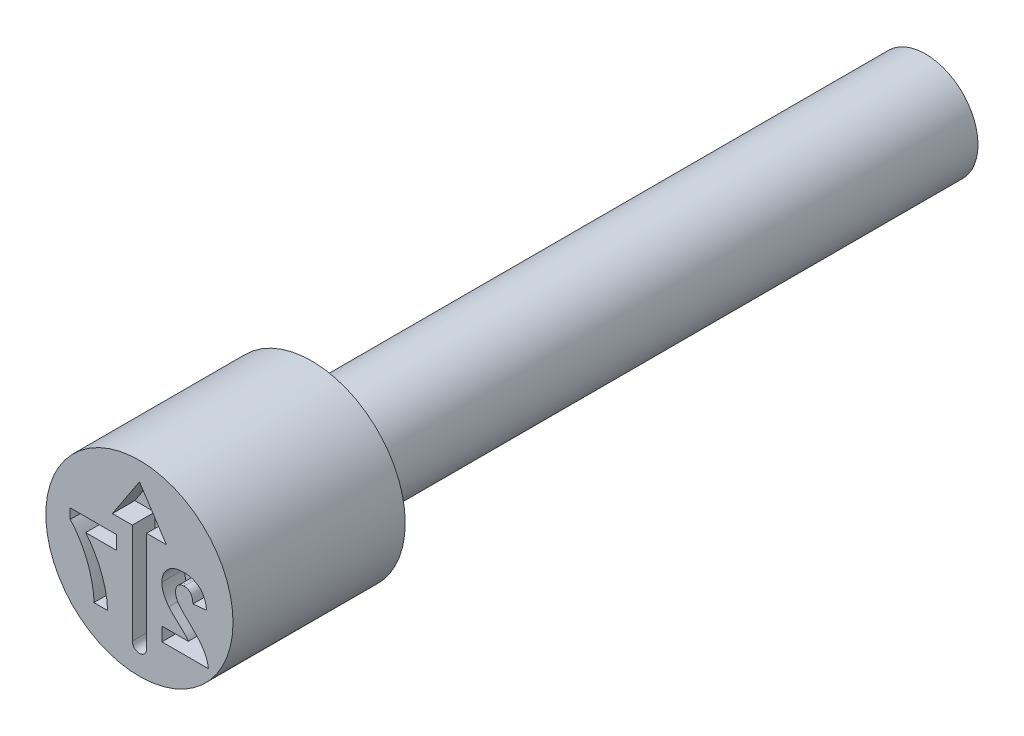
ISO-10303-21;
HEADER;
FILE_DESCRIPTION(('STEP AP214'),'2;1');
FILE_NAME('part.step','',(''),(''),'','','');
FILE_SCHEMA(('AUTOMOTIVE_DESIGN { 1 0 10303 214 1 1 1 1 }'));
ENDSEC;
DATA;
#1=APPLICATION_CONTEXT('core data for automotive mechanical design processes');
#2=APPLICATION_PROTOCOL_DEFINITION('international standard','automotive_design',2000,#1);
#3=PRODUCT_CONTEXT('',#1,'mechanical');
#4=PRODUCT('Part','Part','',(#3));
#5=PRODUCT_RELATED_PRODUCT_CATEGORY('part','',(#4));
#6=PRODUCT_DEFINITION_FORMATION('','',#4);
#7=PRODUCT_DEFINITION_CONTEXT('part definition',#1,'design');
#8=PRODUCT_DEFINITION('design','',#6,#7);
#9=PRODUCT_DEFINITION_SHAPE('','',#8);
#10=(LENGTH_UNIT() NAMED_UNIT(*) SI_UNIT(.MILLI.,.METRE.));
#11=(NAMED_UNIT(*) PLANE_ANGLE_UNIT() SI_UNIT($,.RADIAN.));
#12=(NAMED_UNIT(*) SI_UNIT($,.STERADIAN.) SOLID_ANGLE_UNIT());
#13=UNCERTAINTY_MEASURE_WITH_UNIT(LENGTH_MEASURE(1.E-05),#10,'distance_accuracy_value','');
#14=(GEOMETRIC_REPRESENTATION_CONTEXT(3) GLOBAL_UNCERTAINTY_ASSIGNED_CONTEXT((#13)) GLOBAL_UNIT_ASSIGNED_CONTEXT((#10,
#11,#12)) REPRESENTATION_CONTEXT('',''));
#15=CARTESIAN_POINT('',(0.,0.,0.));
#16=DIRECTION('',(0.,0.,1.));
#17=DIRECTION('',(1.,0.,0.));
#18=AXIS2_PLACEMENT_3D('',#15,#16,#17);
#19=CARTESIAN_POINT('',(0.,0.699999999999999,-2.3));
#20=DIRECTION('',(0.,0.,1.));
#21=DIRECTION('',(1.,0.,0.));
#22=AXIS2_PLACEMENT_3D('',#19,#20,#21);
#23=PLANE('',#22);
#24=CARTESIAN_POINT('',(0.,0.,-2.3));
#25=DIRECTION('',(0.,0.,1.));
#26=DIRECTION('',(1.,0.,0.));
#27=AXIS2_PLACEMENT_3D('',#24,#25,#26);
#28=CIRCLE('',#27,1.25);
#29=CARTESIAN_POINT('',(1.25,0.,-2.3));
#30=VERTEX_POINT('',#29);
#31=EDGE_CURVE('E11',#30,#30,#28,.T.);
#32=ORIENTED_EDGE('',*,*,#31,.F.);
#33=EDGE_LOOP('',(#32));
#34=FACE_BOUND('',#33,.T.);
#35=CARTESIAN_POINT('',(0.,0.,-2.3));
#36=DIRECTION('',(0.,0.,1.));
#37=DIRECTION('',(1.,0.,0.));
#38=AXIS2_PLACEMENT_3D('',#35,#36,#37);
#39=CIRCLE('',#38,0.699999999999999);
#40=CARTESIAN_POINT('',(0.699999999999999,0.,-2.3));
#41=VERTEX_POINT('',#40);
#42=EDGE_CURVE('E390',#41,#41,#39,.T.);
#43=ORIENTED_EDGE('',*,*,#42,.T.);
#44=EDGE_LOOP('',(#43));
#45=FACE_BOUND('',#44,.T.);
#46=ADVANCED_FACE('F39',(#34,#45),#23,.F.);
#47=CARTESIAN_POINT('',(0.,0.,-0.403888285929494));
#48=DIRECTION('',(0.,0.,1.));
#49=DIRECTION('',(1.,0.,0.));
#50=AXIS2_PLACEMENT_3D('',#47,#48,#49);
#51=CYLINDRICAL_SURFACE('',#50,1.25);
#52=CARTESIAN_POINT('',(0.,0.,0.));
#53=DIRECTION('',(0.,0.,1.));
#54=DIRECTION('',(1.,0.,0.));
#55=AXIS2_PLACEMENT_3D('',#52,#53,#54);
#56=CIRCLE('',#55,1.25);
#57=CARTESIAN_POINT('',(1.25,0.,0.));
#58=VERTEX_POINT('',#57);
#59=EDGE_CURVE('E46',#58,#58,#56,.T.);
#60=ORIENTED_EDGE('',*,*,#59,.F.);
#61=EDGE_LOOP('',(#60));
#62=FACE_BOUND('',#61,.T.);
#63=ORIENTED_EDGE('',*,*,#31,.T.);
#64=EDGE_LOOP('',(#63));
#65=FACE_BOUND('',#64,.T.);
#66=ADVANCED_FACE('F412',(#62,#65),#51,.T.);
#67=CARTESIAN_POINT('',(0.,1.25,0.));
#68=DIRECTION('',(0.,0.,-1.));
#69=DIRECTION('',(-1.,0.,0.));
#70=AXIS2_PLACEMENT_3D('',#67,#68,#69);
#71=PLANE('',#70);
#72=DIRECTION('',(0.,-1.,0.));
#73=VECTOR('',#72,1.);
#74=CARTESIAN_POINT('',(0.300150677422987,-0.517307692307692,0.));
#75=LINE('',#74,#73);
#76=CARTESIAN_POINT('',(0.300150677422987,-0.517307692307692,0.));
#77=VERTEX_POINT('',#76);
#78=CARTESIAN_POINT('',(0.300150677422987,-0.7,0.));
#79=VERTEX_POINT('',#78);
#80=EDGE_CURVE('E599',#77,#79,#75,.T.);
#81=ORIENTED_EDGE('',*,*,#80,.F.);
#82=DIRECTION('',(-1.,0.,0.));
#83=VECTOR('',#82,1.);
#84=CARTESIAN_POINT('',(0.653165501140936,-0.517307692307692,0.));
#85=LINE('',#84,#83);
#86=CARTESIAN_POINT('',(0.653165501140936,-0.517307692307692,0.));
#87=VERTEX_POINT('',#86);
#88=EDGE_CURVE('E53',#87,#77,#85,.T.);
#89=ORIENTED_EDGE('',*,*,#88,.F.);
#90=CARTESIAN_POINT('',(0.392258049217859,-0.246694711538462,0.));
#91=CARTESIAN_POINT('',(0.395147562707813,-0.250334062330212,0.));
#92=CARTESIAN_POINT('',(0.40133623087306,-0.258128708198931,0.));
#93=CARTESIAN_POINT('',(0.411864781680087,-0.270080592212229,0.));
#94=CARTESIAN_POINT('',(0.424066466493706,-0.283135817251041,0.));
#95=CARTESIAN_POINT('',(0.43776894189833,-0.297538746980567,0.));
#96=CARTESIAN_POINT('',(0.453424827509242,-0.312779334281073,0.));
#97=CARTESIAN_POINT('',(0.470470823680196,-0.329494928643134,0.));
#98=CARTESIAN_POINT('',(0.489657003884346,-0.346830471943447,0.));
#99=CARTESIAN_POINT('',(0.509529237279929,-0.365218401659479,0.));
#100=CARTESIAN_POINT('',(0.529487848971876,-0.383115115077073,0.));
#101=CARTESIAN_POINT('',(0.54783269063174,-0.400113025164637,0.));
#102=CARTESIAN_POINT('',(0.564495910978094,-0.415152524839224,0.));
#103=CARTESIAN_POINT('',(0.578701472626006,-0.429063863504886,0.));
#104=CARTESIAN_POINT('',(0.591284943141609,-0.440897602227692,0.));
#105=CARTESIAN_POINT('',(0.601792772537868,-0.451260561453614,0.));
#106=CARTESIAN_POINT('',(0.610421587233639,-0.459901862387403,0.));
#107=CARTESIAN_POINT('',(0.622311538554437,-0.47337145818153,0.));
#108=CARTESIAN_POINT('',(0.63744015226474,-0.491589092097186,0.));
#109=CARTESIAN_POINT('',(0.648083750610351,-0.508996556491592,0.));
#110=CARTESIAN_POINT('',(0.653165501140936,-0.517307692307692,0.));
#111=B_SPLINE_CURVE_WITH_KNOTS('',3,(#90,#91,#92,#93,#94,#95,#96,#97,#98,#99,#100,#101,#102,
#103,#104,#105,#106,#107,#108,#109,#110),.UNSPECIFIED.,.F.,.F.,(4,1,1,1,1,1,1,1,1,1,1,1,1,1,1,1,
1,1,4),(0.,0.0369753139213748,0.0791925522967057,0.126700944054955,0.17918407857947,
0.23736864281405,0.300558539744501,0.369153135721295,0.443112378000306,0.516018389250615,
0.582473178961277,0.642136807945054,0.694619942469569,0.740679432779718,0.779589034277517,
0.812073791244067,0.837814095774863,0.922564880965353,1.),.UNSPECIFIED.);
#112=CARTESIAN_POINT('',(0.392258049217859,-0.246694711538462,0.));
#113=VERTEX_POINT('',#112);
#114=EDGE_CURVE('E238',#113,#87,#111,.T.);
#115=ORIENTED_EDGE('',*,*,#114,.F.);
#116=CARTESIAN_POINT('',(0.300150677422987,-0.00843349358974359,0.));
#117=CARTESIAN_POINT('',(0.300383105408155,-0.0187889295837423,0.));
#118=CARTESIAN_POINT('',(0.300844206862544,-0.0393325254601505,0.));
#119=CARTESIAN_POINT('',(0.305258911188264,-0.0697020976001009,0.));
#120=CARTESIAN_POINT('',(0.312003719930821,-0.0993713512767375,0.));
#121=CARTESIAN_POINT('',(0.321972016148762,-0.128412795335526,0.));
#122=CARTESIAN_POINT('',(0.334607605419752,-0.157523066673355,0.));
#123=CARTESIAN_POINT('',(0.350895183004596,-0.18676750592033,0.));
#124=CARTESIAN_POINT('',(0.369806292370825,-0.217028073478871,0.));
#125=CARTESIAN_POINT('',(0.38461294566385,-0.236592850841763,0.));
#126=CARTESIAN_POINT('',(0.392258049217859,-0.246694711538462,0.));
#127=B_SPLINE_CURVE_WITH_KNOTS('',3,(#116,#117,#118,#119,#120,#121,#122,#123,#124,#125,#126),
.UNSPECIFIED.,.F.,.F.,(4,1,1,1,1,1,1,1,4),(0.,0.119176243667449,0.236427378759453,
0.352663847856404,0.469086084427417,0.589462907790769,0.717601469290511,0.854189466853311,1.),.UNSPECIFIED.);
#128=CARTESIAN_POINT('',(0.300150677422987,-0.00843349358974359,0.));
#129=VERTEX_POINT('',#128);
#130=EDGE_CURVE('E241',#129,#113,#127,.T.);
#131=ORIENTED_EDGE('',*,*,#130,.F.);
#132=CARTESIAN_POINT('',(0.591697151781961,0.25,0.));
#133=CARTESIAN_POINT('',(0.580651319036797,0.249787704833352,0.));
#134=CARTESIAN_POINT('',(0.559138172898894,0.249374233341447,0.));
#135=CARTESIAN_POINT('',(0.527732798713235,0.24595978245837,0.));
#136=CARTESIAN_POINT('',(0.498229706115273,0.24000619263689,0.));
#137=CARTESIAN_POINT('',(0.470370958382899,0.232119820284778,0.));
#138=CARTESIAN_POINT('',(0.444442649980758,0.221590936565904,0.));
#139=CARTESIAN_POINT('',(0.420228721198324,0.208861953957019,0.));
#140=CARTESIAN_POINT('',(0.398110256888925,0.193449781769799,0.));
#141=CARTESIAN_POINT('',(0.377757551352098,0.176194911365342,0.));
#142=CARTESIAN_POINT('',(0.359563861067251,0.157220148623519,0.));
#143=CARTESIAN_POINT('',(0.343627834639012,0.136980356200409,0.));
#144=CARTESIAN_POINT('',(0.330276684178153,0.1154896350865,0.));
#145=CARTESIAN_POINT('',(0.319073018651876,0.0930099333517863,0.));
#146=CARTESIAN_POINT('',(0.310754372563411,0.0691795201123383,0.));
#147=CARTESIAN_POINT('',(0.304693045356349,0.0443279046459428,0.));
#148=CARTESIAN_POINT('',(0.300674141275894,0.0183391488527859,0.));
#149=CARTESIAN_POINT('',(0.300327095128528,0.000589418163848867,0.));
#150=CARTESIAN_POINT('',(0.300150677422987,-0.00843349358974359,0.));
#151=B_SPLINE_CURVE_WITH_KNOTS('',3,(#132,#133,#134,#135,#136,#137,#138,#139,#140,#141,#142,
#143,#144,#145,#146,#147,#148,#149,#150),.UNSPECIFIED.,.F.,.F.,(4,1,1,1,1,1,1,1,1,1,1,1,1,1,1,1,
4),(0.,0.0756723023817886,0.147381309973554,0.216084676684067,0.28169803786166,
0.345459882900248,0.407485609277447,0.46873129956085,0.529782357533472,0.590032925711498,
0.648548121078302,0.70595351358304,0.763101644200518,0.820289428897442,0.878479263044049,
0.938226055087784,1.),.UNSPECIFIED.);
#152=CARTESIAN_POINT('',(0.591697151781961,0.25,0.));
#153=VERTEX_POINT('',#152);
#154=EDGE_CURVE('E534',#153,#129,#151,.T.);
#155=ORIENTED_EDGE('',*,*,#154,.F.);
#156=CARTESIAN_POINT('',(0.896945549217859,-0.0365985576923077,0.));
#157=CARTESIAN_POINT('',(0.895476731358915,-0.024264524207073,0.));
#158=CARTESIAN_POINT('',(0.892628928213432,-0.000350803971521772,0.));
#159=CARTESIAN_POINT('',(0.885522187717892,0.0339975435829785,0.));
#160=CARTESIAN_POINT('',(0.876521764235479,0.0656854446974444,0.));
#161=CARTESIAN_POINT('',(0.865198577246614,0.0946540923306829,0.));
#162=CARTESIAN_POINT('',(0.852020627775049,0.121087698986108,0.));
#163=CARTESIAN_POINT('',(0.83631573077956,0.144589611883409,0.));
#164=CARTESIAN_POINT('',(0.818632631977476,0.16542016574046,0.));
#165=CARTESIAN_POINT('',(0.798956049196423,0.183568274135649,0.));
#166=CARTESIAN_POINT('',(0.777411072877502,0.199091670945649,0.));
#167=CARTESIAN_POINT('',(0.754803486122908,0.21294868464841,0.));
#168=CARTESIAN_POINT('',(0.730691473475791,0.224315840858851,0.));
#169=CARTESIAN_POINT('',(0.705340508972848,0.233684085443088,0.));
#170=CARTESIAN_POINT('',(0.67876204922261,0.241171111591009,0.));
#171=CARTESIAN_POINT('',(0.650833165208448,0.246121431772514,0.));
#172=CARTESIAN_POINT('',(0.62172622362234,0.249603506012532,0.));
#173=CARTESIAN_POINT('',(0.601857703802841,0.249865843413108,0.));
#174=CARTESIAN_POINT('',(0.591697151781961,0.25,0.));
#175=B_SPLINE_CURVE_WITH_KNOTS('',3,(#156,#157,#158,#159,#160,#161,#162,#163,#164,#165,#166,
#167,#168,#169,#170,#171,#172,#173,#174),.UNSPECIFIED.,.F.,.F.,(4,1,1,1,1,1,1,1,1,1,1,1,1,1,1,1,
4),(0.,0.0794357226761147,0.154013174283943,0.224141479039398,0.289934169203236,
0.352732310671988,0.412725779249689,0.470302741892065,0.527168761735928,0.583502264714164,
0.639948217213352,0.696584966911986,0.753726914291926,0.812707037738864,0.872963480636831,
0.935034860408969,1.),.UNSPECIFIED.);
#176=CARTESIAN_POINT('',(0.896945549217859,-0.0365985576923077,0.));
#177=VERTEX_POINT('',#176);
#178=EDGE_CURVE('E542',#177,#153,#175,.T.);
#179=ORIENTED_EDGE('',*,*,#178,.F.);
#180=DIRECTION('',(0.995240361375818,0.0974506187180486,0.));
#181=VECTOR('',#180,1.);
#182=CARTESIAN_POINT('',(0.714253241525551,-0.0544871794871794,0.));
#183=LINE('',#182,#181);
#184=CARTESIAN_POINT('',(0.714253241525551,-0.0544871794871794,0.));
#185=VERTEX_POINT('',#184);
#186=EDGE_CURVE('E550',#185,#177,#183,.T.);
#187=ORIENTED_EDGE('',*,*,#186,.F.);
#188=CARTESIAN_POINT('',(0.595503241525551,0.0916666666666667,0.));
#189=CARTESIAN_POINT('',(0.6037893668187,0.091291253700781,0.));
#190=CARTESIAN_POINT('',(0.619796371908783,0.0905660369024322,0.));
#191=CARTESIAN_POINT('',(0.642545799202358,0.0842306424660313,0.));
#192=CARTESIAN_POINT('',(0.662447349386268,0.0732634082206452,0.));
#193=CARTESIAN_POINT('',(0.676630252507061,0.060765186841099,0.));
#194=CARTESIAN_POINT('',(0.686211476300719,0.0486115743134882,0.));
#195=CARTESIAN_POINT('',(0.692739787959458,0.0380205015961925,0.));
#196=CARTESIAN_POINT('',(0.698366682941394,0.0259857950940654,0.));
#197=CARTESIAN_POINT('',(0.703352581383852,0.0126429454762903,0.));
#198=CARTESIAN_POINT('',(0.707290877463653,-0.00216090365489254,0.));
#199=CARTESIAN_POINT('',(0.71046253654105,-0.0183130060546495,0.));
#200=CARTESIAN_POINT('',(0.713018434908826,-0.0359002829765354,0.));
#201=CARTESIAN_POINT('',(0.713831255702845,-0.0481352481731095,0.));
#202=CARTESIAN_POINT('',(0.714253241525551,-0.0544871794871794,0.));
#203=B_SPLINE_CURVE_WITH_KNOTS('',3,(#188,#189,#190,#191,#192,#193,#194,#195,#196,#197,#198,
#199,#200,#201,#202),.UNSPECIFIED.,.F.,.F.,(4,1,1,1,1,1,1,1,1,1,1,1,4),(0.,0.116899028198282,
0.225823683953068,0.330086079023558,0.435451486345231,0.490306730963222,0.548244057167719,
0.610766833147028,0.677675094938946,0.749188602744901,0.826858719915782,0.910111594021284,1.),.UNSPECIFIED.);
#204=CARTESIAN_POINT('',(0.595503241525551,0.0916666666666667,0.));
#205=VERTEX_POINT('',#204);
#206=EDGE_CURVE('E556',#205,#185,#203,.T.);
#207=ORIENTED_EDGE('',*,*,#206,.F.);
#208=CARTESIAN_POINT('',(0.482842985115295,-0.0329827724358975,0.));
#209=CARTESIAN_POINT('',(0.483185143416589,-0.0235042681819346,0.));
#210=CARTESIAN_POINT('',(0.483832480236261,-0.00557167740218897,0.));
#211=CARTESIAN_POINT('',(0.48926051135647,0.0197345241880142,0.));
#212=CARTESIAN_POINT('',(0.498886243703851,0.0414887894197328,0.));
#213=CARTESIAN_POINT('',(0.5121391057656,0.0597578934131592,0.));
#214=CARTESIAN_POINT('',(0.528897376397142,0.0740716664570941,0.));
#215=CARTESIAN_POINT('',(0.548488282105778,0.0846481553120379,0.));
#216=CARTESIAN_POINT('',(0.571198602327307,0.0904955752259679,0.));
#217=CARTESIAN_POINT('',(0.587160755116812,0.0912646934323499,0.));
#218=CARTESIAN_POINT('',(0.595503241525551,0.0916666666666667,0.));
#219=B_SPLINE_CURVE_WITH_KNOTS('',3,(#208,#209,#210,#211,#212,#213,#214,#215,#216,#217,#218),
.UNSPECIFIED.,.F.,.F.,(4,1,1,1,1,1,1,1,4),(0.,0.149140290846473,0.282161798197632,
0.404655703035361,0.521109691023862,0.634416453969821,0.748796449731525,0.868710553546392,1.),.UNSPECIFIED.);
#220=CARTESIAN_POINT('',(0.482842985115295,-0.0329827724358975,0.));
#221=VERTEX_POINT('',#220);
#222=EDGE_CURVE('E561',#221,#205,#219,.T.);
#223=ORIENTED_EDGE('',*,*,#222,.F.);
#224=CARTESIAN_POINT('',(0.519000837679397,-0.142788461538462,0.));
#225=CARTESIAN_POINT('',(0.513500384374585,-0.133651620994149,0.));
#226=CARTESIAN_POINT('',(0.502890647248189,-0.116027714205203,0.));
#227=CARTESIAN_POINT('',(0.491256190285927,-0.0883138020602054,0.));
#228=CARTESIAN_POINT('',(0.484272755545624,-0.0606056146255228,0.));
#229=CARTESIAN_POINT('',(0.483314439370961,-0.0420911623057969,0.));
#230=CARTESIAN_POINT('',(0.482842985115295,-0.0329827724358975,0.));
#231=B_SPLINE_CURVE_WITH_KNOTS('',3,(#224,#225,#226,#227,#228,#229,#230),.UNSPECIFIED.,.F.,.F.,
(4,1,1,1,4),(0.,0.272795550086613,0.526191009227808,0.766904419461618,1.),.UNSPECIFIED.);
#232=CARTESIAN_POINT('',(0.519000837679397,-0.142788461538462,0.));
#233=VERTEX_POINT('',#232);
#234=EDGE_CURVE('E569',#233,#221,#231,.T.);
#235=ORIENTED_EDGE('',*,*,#234,.F.);
#236=CARTESIAN_POINT('',(0.664393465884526,-0.296173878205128,0.));
#237=CARTESIAN_POINT('',(0.65500078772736,-0.287107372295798,0.));
#238=CARTESIAN_POINT('',(0.637119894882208,-0.269847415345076,0.));
#239=CARTESIAN_POINT('',(0.611657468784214,-0.245131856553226,0.));
#240=CARTESIAN_POINT('',(0.589273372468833,-0.222411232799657,0.));
#241=CARTESIAN_POINT('',(0.569499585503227,-0.202274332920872,0.));
#242=CARTESIAN_POINT('',(0.552792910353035,-0.184208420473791,0.));
#243=CARTESIAN_POINT('',(0.538933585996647,-0.168497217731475,0.));
#244=CARTESIAN_POINT('',(0.52774608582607,-0.155076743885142,0.));
#245=CARTESIAN_POINT('',(0.521686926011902,-0.146562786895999,0.));
#246=CARTESIAN_POINT('',(0.519000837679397,-0.142788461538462,0.));
#247=B_SPLINE_CURVE_WITH_KNOTS('',3,(#236,#237,#238,#239,#240,#241,#242,#243,#244,#245,#246),
.UNSPECIFIED.,.F.,.F.,(4,1,1,1,1,1,1,1,4),(0.,0.18509006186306,0.352356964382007,
0.503079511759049,0.637279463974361,0.752473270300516,0.851885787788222,0.934339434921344,1.),.UNSPECIFIED.);
#248=CARTESIAN_POINT('',(0.664393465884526,-0.296173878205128,0.));
#249=VERTEX_POINT('',#248);
#250=EDGE_CURVE('E577',#249,#233,#247,.T.);
#251=ORIENTED_EDGE('',*,*,#250,.F.);
#252=CARTESIAN_POINT('',(0.921304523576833,-0.7,0.));
#253=CARTESIAN_POINT('',(0.919201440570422,-0.684386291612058,0.));
#254=CARTESIAN_POINT('',(0.914996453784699,-0.653167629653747,0.));
#255=CARTESIAN_POINT('',(0.901996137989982,-0.607565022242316,0.));
#256=CARTESIAN_POINT('',(0.884645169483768,-0.563064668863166,0.));
#257=CARTESIAN_POINT('',(0.865813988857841,-0.526852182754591,0.));
#258=CARTESIAN_POINT('',(0.8470842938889,-0.49770237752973,0.));
#259=CARTESIAN_POINT('',(0.830090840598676,-0.473816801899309,0.));
#260=CARTESIAN_POINT('',(0.809818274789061,-0.448403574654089,0.));
#261=CARTESIAN_POINT('',(0.786560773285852,-0.421257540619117,0.));
#262=CARTESIAN_POINT('',(0.760446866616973,-0.392293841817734,0.));
#263=CARTESIAN_POINT('',(0.731281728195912,-0.3616201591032,0.));
#264=CARTESIAN_POINT('',(0.698926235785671,-0.329383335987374,0.));
#265=CARTESIAN_POINT('',(0.676163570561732,-0.307492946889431,0.));
#266=CARTESIAN_POINT('',(0.664393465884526,-0.296173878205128,0.));
#267=B_SPLINE_CURVE_WITH_KNOTS('',3,(#252,#253,#254,#255,#256,#257,#258,#259,#260,#261,#262,
#263,#264,#265,#266),.UNSPECIFIED.,.F.,.F.,(4,1,1,1,1,1,1,1,1,1,1,1,4),(0.,0.0963574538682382,
0.192660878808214,0.289454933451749,0.388479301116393,0.441921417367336,0.501521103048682,
0.567882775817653,0.640891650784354,0.72037065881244,0.806636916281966,0.900015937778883,1.),.UNSPECIFIED.);
#268=CARTESIAN_POINT('',(0.921304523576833,-0.7,0.));
#269=VERTEX_POINT('',#268);
#270=EDGE_CURVE('E585',#269,#249,#267,.T.);
#271=ORIENTED_EDGE('',*,*,#270,.F.);
#272=DIRECTION('',(1.,0.,0.));
#273=VECTOR('',#272,1.);
#274=CARTESIAN_POINT('',(0.300150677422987,-0.7,0.));
#275=LINE('',#274,#273);
#276=EDGE_CURVE('E593',#79,#269,#275,.T.);
#277=ORIENTED_EDGE('',*,*,#276,.F.);
#278=EDGE_LOOP('',(#81,#89,#115,#131,#155,#179,#187,#207,#223,#235,#251,#271,#277));
#279=FACE_BOUND('',#278,.T.);
#280=DIRECTION('',(0.,1.,0.));
#281=VECTOR('',#280,1.);
#282=CARTESIAN_POINT('',(-0.303464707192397,0.0551282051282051,0.));
#283=LINE('',#282,#281);
#284=CARTESIAN_POINT('',(-0.303464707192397,0.055128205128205,0.));
#285=VERTEX_POINT('',#284);
#286=CARTESIAN_POINT('',(-0.303464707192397,0.237820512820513,0.));
#287=VERTEX_POINT('',#286);
#288=EDGE_CURVE('E303',#285,#287,#283,.T.);
#289=ORIENTED_EDGE('',*,*,#288,.F.);
#290=DIRECTION('',(1.,0.,0.));
#291=VECTOR('',#290,1.);
#292=CARTESIAN_POINT('',(-0.717757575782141,0.0551282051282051,0.));
#293=LINE('',#292,#291);
#294=CARTESIAN_POINT('',(-0.717757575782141,0.0551282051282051,0.));
#295=VERTEX_POINT('',#294);
#296=EDGE_CURVE('E61',#295,#285,#293,.T.);
#297=ORIENTED_EDGE('',*,*,#296,.F.);
#298=CARTESIAN_POINT('',(-0.425259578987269,-0.7,0.));
#299=CARTESIAN_POINT('',(-0.425870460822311,-0.683815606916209,0.));
#300=CARTESIAN_POINT('',(-0.427099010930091,-0.65126702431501,0.));
#301=CARTESIAN_POINT('',(-0.43169556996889,-0.602412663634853,0.));
#302=CARTESIAN_POINT('',(-0.43891496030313,-0.553376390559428,0.));
#303=CARTESIAN_POINT('',(-0.447881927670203,-0.504044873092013,0.));
#304=CARTESIAN_POINT('',(-0.459720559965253,-0.454538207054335,0.));
#305=CARTESIAN_POINT('',(-0.473232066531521,-0.404673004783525,0.));
#306=CARTESIAN_POINT('',(-0.489599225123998,-0.354715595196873,0.));
#307=CARTESIAN_POINT('',(-0.507946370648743,-0.304761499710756,0.));
#308=CARTESIAN_POINT('',(-0.528200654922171,-0.255284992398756,0.));
#309=CARTESIAN_POINT('',(-0.550274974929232,-0.206899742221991,0.));
#310=CARTESIAN_POINT('',(-0.574112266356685,-0.159907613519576,0.));
#311=CARTESIAN_POINT('',(-0.599402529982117,-0.114143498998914,0.));
#312=CARTESIAN_POINT('',(-0.626439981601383,-0.0697546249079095,0.));
#313=CARTESIAN_POINT('',(-0.655244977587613,-0.0267891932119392,0.));
#314=CARTESIAN_POINT('',(-0.685408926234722,0.0150635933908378,0.));
#315=CARTESIAN_POINT('',(-0.706976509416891,0.0417755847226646,0.));
#316=CARTESIAN_POINT('',(-0.717757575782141,0.0551282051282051,0.));
#317=B_SPLINE_CURVE_WITH_KNOTS('',3,(#298,#299,#300,#301,#302,#303,#304,#305,#306,#307,#308,
#309,#310,#311,#312,#313,#314,#315,#316),.UNSPECIFIED.,.F.,.F.,(4,1,1,1,1,1,1,1,1,1,1,1,1,1,1,1,
4),(0.,0.0589531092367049,0.118561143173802,0.178522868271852,0.239353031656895,
0.301026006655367,0.363773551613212,0.427382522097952,0.492333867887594,0.557475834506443,
0.621960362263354,0.685889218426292,0.749254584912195,0.812267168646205,0.875035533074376,
0.937533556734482,1.),.UNSPECIFIED.);
#318=CARTESIAN_POINT('',(-0.425259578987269,-0.7,0.));
#319=VERTEX_POINT('',#318);
#320=EDGE_CURVE('E323',#319,#295,#317,.T.);
#321=ORIENTED_EDGE('',*,*,#320,.F.);
#322=DIRECTION('',(1.,0.,0.));
#323=VECTOR('',#322,1.);
#324=CARTESIAN_POINT('',(-0.607951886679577,-0.7,0.));
#325=LINE('',#324,#323);
#326=CARTESIAN_POINT('',(-0.607951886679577,-0.7,0.));
#327=VERTEX_POINT('',#326);
#328=EDGE_CURVE('E317',#327,#319,#325,.T.);
#329=ORIENTED_EDGE('',*,*,#328,.F.);
#330=CARTESIAN_POINT('',(-0.924618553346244,0.103846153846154,0.));
#331=CARTESIAN_POINT('',(-0.918138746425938,0.0972531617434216,0.));
#332=CARTESIAN_POINT('',(-0.904818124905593,0.0836998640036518,0.));
#333=CARTESIAN_POINT('',(-0.885737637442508,0.0615185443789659,0.));
#334=CARTESIAN_POINT('',(-0.866374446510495,0.0374479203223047,0.));
#335=CARTESIAN_POINT('',(-0.847133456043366,0.0111636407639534,0.));
#336=CARTESIAN_POINT('',(-0.827416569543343,-0.0169190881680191,0.));
#337=CARTESIAN_POINT('',(-0.808090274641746,-0.0473385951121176,0.));
#338=CARTESIAN_POINT('',(-0.788489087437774,-0.0797002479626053,0.));
#339=CARTESIAN_POINT('',(-0.762099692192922,-0.125475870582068,0.));
#340=CARTESIAN_POINT('',(-0.731253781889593,-0.185272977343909,0.));
#341=CARTESIAN_POINT('',(-0.698620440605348,-0.259603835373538,0.));
#342=CARTESIAN_POINT('',(-0.670818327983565,-0.33621746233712,0.));
#343=CARTESIAN_POINT('',(-0.651780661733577,-0.401497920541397,0.));
#344=CARTESIAN_POINT('',(-0.638917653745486,-0.453820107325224,0.));
#345=CARTESIAN_POINT('',(-0.630513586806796,-0.492079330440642,0.));
#346=CARTESIAN_POINT('',(-0.6234391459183,-0.529261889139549,0.));
#347=CARTESIAN_POINT('',(-0.617684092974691,-0.565433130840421,0.));
#348=CARTESIAN_POINT('',(-0.61338893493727,-0.600609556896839,0.));
#349=CARTESIAN_POINT('',(-0.60999502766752,-0.634668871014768,0.));
#350=CARTESIAN_POINT('',(-0.608320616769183,-0.667694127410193,0.));
#351=CARTESIAN_POINT('',(-0.608073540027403,-0.689341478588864,0.));
#352=CARTESIAN_POINT('',(-0.607951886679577,-0.7,0.));
#353=B_SPLINE_CURVE_WITH_KNOTS('',3,(#330,#331,#332,#333,#334,#335,#336,#337,#338,#339,#340,
#341,#342,#343,#344,#345,#346,#347,#348,#349,#350,#351,#352),.UNSPECIFIED.,.F.,.F.,(4,1,1,1,1,1,
1,1,1,1,1,1,1,1,1,1,1,1,1,1,4),(0.,0.0314272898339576,0.0646054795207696,0.0994393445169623,
0.136456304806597,0.175351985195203,0.216100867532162,0.258977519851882,0.304007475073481,
0.395756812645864,0.487615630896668,0.579873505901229,0.672707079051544,0.718694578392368,
0.76307923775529,0.805893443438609,0.847386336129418,0.88760014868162,0.926386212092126,
0.963754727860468,1.),.UNSPECIFIED.);
#354=CARTESIAN_POINT('',(-0.924618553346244,0.103846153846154,0.));
#355=VERTEX_POINT('',#354);
#356=EDGE_CURVE('E312',#355,#327,#353,.T.);
#357=ORIENTED_EDGE('',*,*,#356,.F.);
#358=DIRECTION('',(0.,-1.,0.));
#359=VECTOR('',#358,1.);
#360=CARTESIAN_POINT('',(-0.924618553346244,0.237820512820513,0.));
#361=LINE('',#360,#359);
#362=CARTESIAN_POINT('',(-0.924618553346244,0.237820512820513,0.));
#363=VERTEX_POINT('',#362);
#364=EDGE_CURVE('E309',#363,#355,#361,.T.);
#365=ORIENTED_EDGE('',*,*,#364,.F.);
#366=DIRECTION('',(-1.,0.,0.));
#367=VECTOR('',#366,1.);
#368=CARTESIAN_POINT('',(-0.303464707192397,0.237820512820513,0.));
#369=LINE('',#368,#367);
#370=EDGE_CURVE('E306',#287,#363,#369,.T.);
#371=ORIENTED_EDGE('',*,*,#370,.F.);
#372=EDGE_LOOP('',(#289,#297,#321,#329,#357,#365,#371));
#373=FACE_BOUND('',#372,.T.);
#374=DIRECTION('',(0.,1.,0.));
#375=VECTOR('',#374,1.);
#376=CARTESIAN_POINT('',(0.0952365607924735,0.453175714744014,0.));
#377=LINE('',#376,#375);
#378=CARTESIAN_POINT('',(0.0952365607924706,-0.888080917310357,0.));
#379=VERTEX_POINT('',#378);
#380=CARTESIAN_POINT('',(0.0952365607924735,0.453175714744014,0.));
#381=VERTEX_POINT('',#380);
#382=EDGE_CURVE('E370',#379,#381,#377,.T.);
#383=ORIENTED_EDGE('',*,*,#382,.F.);
#384=CARTESIAN_POINT('',(0.,-0.888080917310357,0.));
#385=DIRECTION('',(0.,0.,1.));
#386=DIRECTION('',(1.,0.,0.));
#387=AXIS2_PLACEMENT_3D('',#384,#385,#386);
#388=CIRCLE('',#387,0.0952365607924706);
#389=CARTESIAN_POINT('',(-0.0952365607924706,-0.888080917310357,0.));
#390=VERTEX_POINT('',#389);
#391=EDGE_CURVE('E368',#390,#379,#388,.T.);
#392=ORIENTED_EDGE('',*,*,#391,.F.);
#393=DIRECTION('',(0.,-1.,0.));
#394=VECTOR('',#393,1.);
#395=CARTESIAN_POINT('',(-0.0952365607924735,0.453175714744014,0.));
#396=LINE('',#395,#394);
#397=CARTESIAN_POINT('',(-0.0952365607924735,0.453175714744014,0.));
#398=VERTEX_POINT('',#397);
#399=EDGE_CURVE('E349',#398,#390,#396,.T.);
#400=ORIENTED_EDGE('',*,*,#399,.F.);
#401=DIRECTION('',(1.,0.,0.));
#402=VECTOR('',#401,1.);
#403=CARTESIAN_POINT('',(-0.360958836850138,0.453175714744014,0.));
#404=LINE('',#403,#402);
#405=CARTESIAN_POINT('',(-0.360958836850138,0.453175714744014,0.));
#406=VERTEX_POINT('',#405);
#407=EDGE_CURVE('E383',#406,#398,#404,.T.);
#408=ORIENTED_EDGE('',*,*,#407,.F.);
#409=DIRECTION('',(-0.550159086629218,-0.835059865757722,0.));
#410=VECTOR('',#409,1.);
#411=CARTESIAN_POINT('',(0.,1.00105767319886,0.));
#412=LINE('',#411,#410);
#413=CARTESIAN_POINT('',(0.,1.00105767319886,0.));
#414=VERTEX_POINT('',#413);
#415=EDGE_CURVE('E380',#414,#406,#412,.T.);
#416=ORIENTED_EDGE('',*,*,#415,.F.);
#417=DIRECTION('',(-0.550159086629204,0.835059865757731,0.));
#418=VECTOR('',#417,1.);
#419=CARTESIAN_POINT('',(0.,1.00105767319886,0.));
#420=LINE('',#419,#418);
#421=CARTESIAN_POINT('',(0.360958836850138,0.453175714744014,0.));
#422=VERTEX_POINT('',#421);
#423=EDGE_CURVE('E377',#422,#414,#420,.T.);
#424=ORIENTED_EDGE('',*,*,#423,.F.);
#425=DIRECTION('',(1.,0.,0.));
#426=VECTOR('',#425,1.);
#427=CARTESIAN_POINT('',(0.360958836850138,0.453175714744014,0.));
#428=LINE('',#427,#426);
#429=EDGE_CURVE('E374',#381,#422,#428,.T.);
#430=ORIENTED_EDGE('',*,*,#429,.F.);
#431=EDGE_LOOP('',(#383,#392,#400,#408,#416,#424,#430));
#432=FACE_BOUND('',#431,.T.);
#433=ORIENTED_EDGE('',*,*,#59,.T.);
#434=EDGE_LOOP('',(#433));
#435=FACE_BOUND('',#434,.T.);
#436=ADVANCED_FACE('F410',(#279,#373,#432,#435),#71,.F.);
#437=CARTESIAN_POINT('',(0.,0.,-10.5));
#438=DIRECTION('',(0.,0.,1.));
#439=DIRECTION('',(1.,0.,0.));
#440=AXIS2_PLACEMENT_3D('',#437,#438,#439);
#441=PLANE('',#440);
#442=CARTESIAN_POINT('',(0.,0.,-10.5));
#443=DIRECTION('',(0.,0.,1.));
#444=DIRECTION('',(1.,0.,0.));
#445=AXIS2_PLACEMENT_3D('',#442,#443,#444);
#446=CIRCLE('',#445,0.7);
#447=CARTESIAN_POINT('',(0.7,0.,-10.5));
#448=VERTEX_POINT('',#447);
#449=EDGE_CURVE('E405',#448,#448,#446,.T.);
#450=ORIENTED_EDGE('',*,*,#449,.F.);
#451=EDGE_LOOP('',(#450));
#452=FACE_BOUND('',#451,.T.);
#453=ADVANCED_FACE('F425',(#452),#441,.F.);
#454=CARTESIAN_POINT('',(0.,0.,-0.403888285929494));
#455=DIRECTION('',(0.,0.,1.));
#456=DIRECTION('',(1.,0.,0.));
#457=AXIS2_PLACEMENT_3D('',#454,#455,#456);
#458=CYLINDRICAL_SURFACE('',#457,0.699999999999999);
#459=ORIENTED_EDGE('',*,*,#42,.F.);
#460=EDGE_LOOP('',(#459));
#461=FACE_BOUND('',#460,.T.);
#462=ORIENTED_EDGE('',*,*,#449,.T.);
#463=EDGE_LOOP('',(#462));
#464=FACE_BOUND('',#463,.T.);
#465=ADVANCED_FACE('F421',(#461,#464),#458,.T.);
#466=CARTESIAN_POINT('',(0.,-0.888080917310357,-0.3));
#467=DIRECTION('',(0.,0.,1.));
#468=DIRECTION('',(1.,0.,0.));
#469=AXIS2_PLACEMENT_3D('',#466,#467,#468);
#470=CYLINDRICAL_SURFACE('',#469,0.0952365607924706);
#471=ORIENTED_EDGE('',*,*,#391,.T.);
#472=DIRECTION('',(0.,0.,1.));
#473=VECTOR('',#472,1.);
#474=CARTESIAN_POINT('',(0.0952365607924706,-0.888080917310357,-0.3));
#475=LINE('',#474,#473);
#476=CARTESIAN_POINT('',(0.0952365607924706,-0.888080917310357,-0.3));
#477=VERTEX_POINT('',#476);
#478=EDGE_CURVE('E367',#477,#379,#475,.T.);
#479=ORIENTED_EDGE('',*,*,#478,.F.);
#480=CARTESIAN_POINT('',(0.,-0.888080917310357,-0.3));
#481=DIRECTION('',(0.,0.,1.));
#482=DIRECTION('',(1.,0.,0.));
#483=AXIS2_PLACEMENT_3D('',#480,#481,#482);
#484=CIRCLE('',#483,0.0952365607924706);
#485=CARTESIAN_POINT('',(-0.0952365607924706,-0.888080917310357,-0.3));
#486=VERTEX_POINT('',#485);
#487=EDGE_CURVE('E345',#486,#477,#484,.T.);
#488=ORIENTED_EDGE('',*,*,#487,.F.);
#489=DIRECTION('',(0.,0.,1.));
#490=VECTOR('',#489,1.);
#491=CARTESIAN_POINT('',(-0.0952365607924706,-0.888080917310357,-0.3));
#492=LINE('',#491,#490);
#493=EDGE_CURVE('E388',#486,#390,#492,.T.);
#494=ORIENTED_EDGE('',*,*,#493,.T.);
#495=EDGE_LOOP('',(#471,#479,#488,#494));
#496=FACE_BOUND('',#495,.T.);
#497=ADVANCED_FACE('F424',(#496),#470,.F.);
#498=CARTESIAN_POINT('',(-0.0952365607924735,0.453175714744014,-0.3));
#499=DIRECTION('',(-1.,0.,0.));
#500=DIRECTION('',(0.,-1.,0.));
#501=AXIS2_PLACEMENT_3D('',#498,#499,#500);
#502=PLANE('',#501);
#503=ORIENTED_EDGE('',*,*,#399,.T.);
#504=ORIENTED_EDGE('',*,*,#493,.F.);
#505=DIRECTION('',(0.,-1.,0.));
#506=VECTOR('',#505,1.);
#507=CARTESIAN_POINT('',(-0.0952365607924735,0.453175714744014,-0.3));
#508=LINE('',#507,#506);
#509=CARTESIAN_POINT('',(-0.0952365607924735,0.453175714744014,-0.3));
#510=VERTEX_POINT('',#509);
#511=EDGE_CURVE('E364',#510,#486,#508,.T.);
#512=ORIENTED_EDGE('',*,*,#511,.F.);
#513=DIRECTION('',(0.,0.,1.));
#514=VECTOR('',#513,1.);
#515=CARTESIAN_POINT('',(-0.0952365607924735,0.453175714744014,-0.3));
#516=LINE('',#515,#514);
#517=EDGE_CURVE('E391',#510,#398,#516,.T.);
#518=ORIENTED_EDGE('',*,*,#517,.T.);
#519=EDGE_LOOP('',(#503,#504,#512,#518));
#520=FACE_BOUND('',#519,.T.);
#521=ADVANCED_FACE('F439',(#520),#502,.F.);
#522=CARTESIAN_POINT('',(-0.360958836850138,0.453175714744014,-0.3));
#523=DIRECTION('',(0.,-1.,0.));
#524=DIRECTION('',(0.,0.,-1.));
#525=AXIS2_PLACEMENT_3D('',#522,#523,#524);
#526=PLANE('',#525);
#527=ORIENTED_EDGE('',*,*,#407,.T.);
#528=ORIENTED_EDGE('',*,*,#517,.F.);
#529=DIRECTION('',(1.,0.,0.));
#530=VECTOR('',#529,1.);
#531=CARTESIAN_POINT('',(-0.360958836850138,0.453175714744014,-0.3));
#532=LINE('',#531,#530);
#533=CARTESIAN_POINT('',(-0.360958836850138,0.453175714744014,-0.3));
#534=VERTEX_POINT('',#533);
#535=EDGE_CURVE('E361',#534,#510,#532,.T.);
#536=ORIENTED_EDGE('',*,*,#535,.F.);
#537=DIRECTION('',(0.,0.,1.));
#538=VECTOR('',#537,1.);
#539=CARTESIAN_POINT('',(-0.360958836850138,0.453175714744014,-0.3));
#540=LINE('',#539,#538);
#541=EDGE_CURVE('E393',#534,#406,#540,.T.);
#542=ORIENTED_EDGE('',*,*,#541,.T.);
#543=EDGE_LOOP('',(#527,#528,#536,#542));
#544=FACE_BOUND('',#543,.T.);
#545=ADVANCED_FACE('F457',(#544),#526,.F.);
#546=CARTESIAN_POINT('',(0.,1.00105767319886,-0.3));
#547=DIRECTION('',(-0.835059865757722,0.550159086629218,0.));
#548=DIRECTION('',(-0.550159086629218,-0.835059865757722,0.));
#549=AXIS2_PLACEMENT_3D('',#546,#547,#548);
#550=PLANE('',#549);
#551=ORIENTED_EDGE('',*,*,#415,.T.);
#552=ORIENTED_EDGE('',*,*,#541,.F.);
#553=DIRECTION('',(-0.550159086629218,-0.835059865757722,0.));
#554=VECTOR('',#553,1.);
#555=CARTESIAN_POINT('',(0.,1.00105767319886,-0.3));
#556=LINE('',#555,#554);
#557=CARTESIAN_POINT('',(0.,1.00105767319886,-0.3));
#558=VERTEX_POINT('',#557);
#559=EDGE_CURVE('E358',#558,#534,#556,.T.);
#560=ORIENTED_EDGE('',*,*,#559,.F.);
#561=DIRECTION('',(0.,0.,1.));
#562=VECTOR('',#561,1.);
#563=CARTESIAN_POINT('',(0.,1.00105767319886,-0.3));
#564=LINE('',#563,#562);
#565=EDGE_CURVE('E395',#558,#414,#564,.T.);
#566=ORIENTED_EDGE('',*,*,#565,.T.);
#567=EDGE_LOOP('',(#551,#552,#560,#566));
#568=FACE_BOUND('',#567,.T.);
#569=ADVANCED_FACE('F453',(#568),#550,.F.);
#570=CARTESIAN_POINT('',(0.,1.00105767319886,-0.3));
#571=DIRECTION('',(0.835059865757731,0.550159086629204,0.));
#572=DIRECTION('',(-0.550159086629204,0.835059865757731,0.));
#573=AXIS2_PLACEMENT_3D('',#570,#571,#572);
#574=PLANE('',#573);
#575=ORIENTED_EDGE('',*,*,#423,.T.);
#576=ORIENTED_EDGE('',*,*,#565,.F.);
#577=DIRECTION('',(-0.550159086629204,0.835059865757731,0.));
#578=VECTOR('',#577,1.);
#579=CARTESIAN_POINT('',(0.,1.00105767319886,-0.3));
#580=LINE('',#579,#578);
#581=CARTESIAN_POINT('',(0.360958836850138,0.453175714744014,-0.3));
#582=VERTEX_POINT('',#581);
#583=EDGE_CURVE('E355',#582,#558,#580,.T.);
#584=ORIENTED_EDGE('',*,*,#583,.F.);
#585=DIRECTION('',(0.,0.,1.));
#586=VECTOR('',#585,1.);
#587=CARTESIAN_POINT('',(0.360958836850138,0.453175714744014,-0.3));
#588=LINE('',#587,#586);
#589=EDGE_CURVE('E397',#582,#422,#588,.T.);
#590=ORIENTED_EDGE('',*,*,#589,.T.);
#591=EDGE_LOOP('',(#575,#576,#584,#590));
#592=FACE_BOUND('',#591,.T.);
#593=ADVANCED_FACE('F449',(#592),#574,.F.);
#594=CARTESIAN_POINT('',(0.360958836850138,0.453175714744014,-0.3));
#595=DIRECTION('',(0.,-1.,0.));
#596=DIRECTION('',(0.,0.,-1.));
#597=AXIS2_PLACEMENT_3D('',#594,#595,#596);
#598=PLANE('',#597);
#599=ORIENTED_EDGE('',*,*,#429,.T.);
#600=ORIENTED_EDGE('',*,*,#589,.F.);
#601=DIRECTION('',(1.,0.,0.));
#602=VECTOR('',#601,1.);
#603=CARTESIAN_POINT('',(0.360958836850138,0.453175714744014,-0.3));
#604=LINE('',#603,#602);
#605=CARTESIAN_POINT('',(0.0952365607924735,0.453175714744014,-0.3));
#606=VERTEX_POINT('',#605);
#607=EDGE_CURVE('E352',#606,#582,#604,.T.);
#608=ORIENTED_EDGE('',*,*,#607,.F.);
#609=DIRECTION('',(0.,0.,1.));
#610=VECTOR('',#609,1.);
#611=CARTESIAN_POINT('',(0.0952365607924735,0.453175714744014,-0.3));
#612=LINE('',#611,#610);
#613=EDGE_CURVE('E399',#606,#381,#612,.T.);
#614=ORIENTED_EDGE('',*,*,#613,.T.);
#615=EDGE_LOOP('',(#599,#600,#608,#614));
#616=FACE_BOUND('',#615,.T.);
#617=ADVANCED_FACE('F445',(#616),#598,.F.);
#618=CARTESIAN_POINT('',(0.0952365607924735,0.453175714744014,-0.3));
#619=DIRECTION('',(1.,0.,0.));
#620=DIRECTION('',(0.,1.,0.));
#621=AXIS2_PLACEMENT_3D('',#618,#619,#620);
#622=PLANE('',#621);
#623=ORIENTED_EDGE('',*,*,#382,.T.);
#624=ORIENTED_EDGE('',*,*,#613,.F.);
#625=DIRECTION('',(0.,1.,0.));
#626=VECTOR('',#625,1.);
#627=CARTESIAN_POINT('',(0.0952365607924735,0.453175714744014,-0.3));
#628=LINE('',#627,#626);
#629=EDGE_CURVE('E348',#477,#606,#628,.T.);
#630=ORIENTED_EDGE('',*,*,#629,.F.);
#631=ORIENTED_EDGE('',*,*,#478,.T.);
#632=EDGE_LOOP('',(#623,#624,#630,#631));
#633=FACE_BOUND('',#632,.T.);
#634=ADVANCED_FACE('F441',(#633),#622,.F.);
#635=CARTESIAN_POINT('',(0.,-0.888080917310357,-0.3));
#636=DIRECTION('',(0.,0.,1.));
#637=DIRECTION('',(1.,0.,0.));
#638=AXIS2_PLACEMENT_3D('',#635,#636,#637);
#639=PLANE('',#638);
#640=ORIENTED_EDGE('',*,*,#487,.T.);
#641=ORIENTED_EDGE('',*,*,#629,.T.);
#642=ORIENTED_EDGE('',*,*,#607,.T.);
#643=ORIENTED_EDGE('',*,*,#583,.T.);
#644=ORIENTED_EDGE('',*,*,#559,.T.);
#645=ORIENTED_EDGE('',*,*,#535,.T.);
#646=ORIENTED_EDGE('',*,*,#511,.T.);
#647=EDGE_LOOP('',(#640,#641,#642,#643,#644,#645,#646));
#648=FACE_BOUND('',#647,.T.);
#649=ADVANCED_FACE('F444',(#648),#639,.T.);
#650=CARTESIAN_POINT('',(-0.717757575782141,0.0551282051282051,-0.3));
#651=DIRECTION('',(0.,-1.,0.));
#652=DIRECTION('',(0.,0.,-1.));
#653=AXIS2_PLACEMENT_3D('',#650,#651,#652);
#654=PLANE('',#653);
#655=ORIENTED_EDGE('',*,*,#296,.T.);
#656=DIRECTION('',(0.,0.,1.));
#657=VECTOR('',#656,1.);
#658=CARTESIAN_POINT('',(-0.303464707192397,0.0551282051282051,-0.3));
#659=LINE('',#658,#657);
#660=CARTESIAN_POINT('',(-0.303464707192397,0.0551282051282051,-0.3));
#661=VERTEX_POINT('',#660);
#662=EDGE_CURVE('E296',#661,#285,#659,.T.);
#663=ORIENTED_EDGE('',*,*,#662,.F.);
#664=DIRECTION('',(1.,0.,0.));
#665=VECTOR('',#664,1.);
#666=CARTESIAN_POINT('',(-0.717757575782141,0.0551282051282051,-0.3));
#667=LINE('',#666,#665);
#668=CARTESIAN_POINT('',(-0.717757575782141,0.0551282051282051,-0.3));
#669=VERTEX_POINT('',#668);
#670=EDGE_CURVE('E328',#669,#661,#667,.T.);
#671=ORIENTED_EDGE('',*,*,#670,.F.);
#672=DIRECTION('',(0.,0.,1.));
#673=VECTOR('',#672,1.);
#674=CARTESIAN_POINT('',(-0.717757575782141,0.0551282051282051,-0.3));
#675=LINE('',#674,#673);
#676=EDGE_CURVE('E329',#669,#295,#675,.T.);
#677=ORIENTED_EDGE('',*,*,#676,.T.);
#678=EDGE_LOOP('',(#655,#663,#671,#677));
#679=FACE_BOUND('',#678,.T.);
#680=ADVANCED_FACE('F286',(#679),#654,.F.);
#681=CARTESIAN_POINT('',(-0.425259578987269,-0.7,-0.3));
#682=CARTESIAN_POINT('',(-0.425870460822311,-0.683815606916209,-0.3));
#683=CARTESIAN_POINT('',(-0.427099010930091,-0.65126702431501,-0.3));
#684=CARTESIAN_POINT('',(-0.43169556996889,-0.602412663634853,-0.3));
#685=CARTESIAN_POINT('',(-0.43891496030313,-0.553376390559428,-0.3));
#686=CARTESIAN_POINT('',(-0.447881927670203,-0.504044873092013,-0.3));
#687=CARTESIAN_POINT('',(-0.459720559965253,-0.454538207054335,-0.3));
#688=CARTESIAN_POINT('',(-0.473232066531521,-0.404673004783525,-0.3));
#689=CARTESIAN_POINT('',(-0.489599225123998,-0.354715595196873,-0.3));
#690=CARTESIAN_POINT('',(-0.507946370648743,-0.304761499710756,-0.3));
#691=CARTESIAN_POINT('',(-0.528200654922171,-0.255284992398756,-0.3));
#692=CARTESIAN_POINT('',(-0.550274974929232,-0.206899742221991,-0.3));
#693=CARTESIAN_POINT('',(-0.574112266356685,-0.159907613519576,-0.3));
#694=CARTESIAN_POINT('',(-0.599402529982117,-0.114143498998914,-0.3));
#695=CARTESIAN_POINT('',(-0.626439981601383,-0.0697546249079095,-0.3));
#696=CARTESIAN_POINT('',(-0.655244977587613,-0.0267891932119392,-0.3));
#697=CARTESIAN_POINT('',(-0.685408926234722,0.0150635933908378,-0.3));
#698=CARTESIAN_POINT('',(-0.706976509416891,0.0417755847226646,-0.3));
#699=CARTESIAN_POINT('',(-0.717757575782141,0.0551282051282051,-0.3));
#700=B_SPLINE_CURVE_WITH_KNOTS('',3,(#681,#682,#683,#684,#685,#686,#687,#688,#689,#690,#691,
#692,#693,#694,#695,#696,#697,#698,#699),.UNSPECIFIED.,.F.,.F.,(4,1,1,1,1,1,1,1,1,1,1,1,1,1,1,1,
4),(0.,0.0589531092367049,0.118561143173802,0.178522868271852,0.239353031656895,
0.301026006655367,0.363773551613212,0.427382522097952,0.492333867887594,0.557475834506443,
0.621960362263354,0.685889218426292,0.749254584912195,0.812267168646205,0.875035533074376,
0.937533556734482,1.),.UNSPECIFIED.);
#701=DIRECTION('',(0.,0.,1.));
#702=VECTOR('',#701,1.);
#703=SURFACE_OF_LINEAR_EXTRUSION('',#700,#702);
#704=ORIENTED_EDGE('',*,*,#320,.T.);
#705=ORIENTED_EDGE('',*,*,#676,.F.);
#706=CARTESIAN_POINT('',(-0.425259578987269,-0.7,-0.3));
#707=VERTEX_POINT('',#706);
#708=EDGE_CURVE('E289',#707,#669,#700,.T.);
#709=ORIENTED_EDGE('',*,*,#708,.F.);
#710=DIRECTION('',(0.,0.,1.));
#711=VECTOR('',#710,1.);
#712=CARTESIAN_POINT('',(-0.425259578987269,-0.7,-0.3));
#713=LINE('',#712,#711);
#714=EDGE_CURVE('E334',#707,#319,#713,.T.);
#715=ORIENTED_EDGE('',*,*,#714,.T.);
#716=EDGE_LOOP('',(#704,#705,#709,#715));
#717=FACE_BOUND('',#716,.T.);
#718=ADVANCED_FACE('F281',(#717),#703,.F.);
#719=CARTESIAN_POINT('',(-0.607951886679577,-0.7,-0.3));
#720=DIRECTION('',(0.,-1.,0.));
#721=DIRECTION('',(0.,0.,-1.));
#722=AXIS2_PLACEMENT_3D('',#719,#720,#721);
#723=PLANE('',#722);
#724=ORIENTED_EDGE('',*,*,#328,.T.);
#725=ORIENTED_EDGE('',*,*,#714,.F.);
#726=DIRECTION('',(1.,0.,0.));
#727=VECTOR('',#726,1.);
#728=CARTESIAN_POINT('',(-0.607951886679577,-0.7,-0.3));
#729=LINE('',#728,#727);
#730=CARTESIAN_POINT('',(-0.607951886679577,-0.7,-0.3));
#731=VERTEX_POINT('',#730);
#732=EDGE_CURVE('E297',#731,#707,#729,.T.);
#733=ORIENTED_EDGE('',*,*,#732,.F.);
#734=DIRECTION('',(0.,0.,1.));
#735=VECTOR('',#734,1.);
#736=CARTESIAN_POINT('',(-0.607951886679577,-0.7,-0.3));
#737=LINE('',#736,#735);
#738=EDGE_CURVE('E336',#731,#327,#737,.T.);
#739=ORIENTED_EDGE('',*,*,#738,.T.);
#740=EDGE_LOOP('',(#724,#725,#733,#739));
#741=FACE_BOUND('',#740,.T.);
#742=ADVANCED_FACE('F285',(#741),#723,.F.);
#743=CARTESIAN_POINT('',(-0.924618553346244,0.103846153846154,-0.3));
#744=CARTESIAN_POINT('',(-0.918138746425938,0.0972531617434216,-0.3));
#745=CARTESIAN_POINT('',(-0.904818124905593,0.0836998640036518,-0.3));
#746=CARTESIAN_POINT('',(-0.885737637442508,0.0615185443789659,-0.3));
#747=CARTESIAN_POINT('',(-0.866374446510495,0.0374479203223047,-0.3));
#748=CARTESIAN_POINT('',(-0.847133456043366,0.0111636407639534,-0.3));
#749=CARTESIAN_POINT('',(-0.827416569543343,-0.0169190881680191,-0.3));
#750=CARTESIAN_POINT('',(-0.808090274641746,-0.0473385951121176,-0.3));
#751=CARTESIAN_POINT('',(-0.788489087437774,-0.0797002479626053,-0.3));
#752=CARTESIAN_POINT('',(-0.762099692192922,-0.125475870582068,-0.3));
#753=CARTESIAN_POINT('',(-0.731253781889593,-0.185272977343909,-0.3));
#754=CARTESIAN_POINT('',(-0.698620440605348,-0.259603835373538,-0.3));
#755=CARTESIAN_POINT('',(-0.670818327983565,-0.33621746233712,-0.3));
#756=CARTESIAN_POINT('',(-0.651780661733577,-0.401497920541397,-0.3));
#757=CARTESIAN_POINT('',(-0.638917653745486,-0.453820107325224,-0.3));
#758=CARTESIAN_POINT('',(-0.630513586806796,-0.492079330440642,-0.3));
#759=CARTESIAN_POINT('',(-0.6234391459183,-0.529261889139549,-0.3));
#760=CARTESIAN_POINT('',(-0.617684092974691,-0.565433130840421,-0.3));
#761=CARTESIAN_POINT('',(-0.61338893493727,-0.600609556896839,-0.3));
#762=CARTESIAN_POINT('',(-0.60999502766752,-0.634668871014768,-0.3));
#763=CARTESIAN_POINT('',(-0.608320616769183,-0.667694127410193,-0.3));
#764=CARTESIAN_POINT('',(-0.608073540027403,-0.689341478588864,-0.3));
#765=CARTESIAN_POINT('',(-0.607951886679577,-0.7,-0.3));
#766=B_SPLINE_CURVE_WITH_KNOTS('',3,(#743,#744,#745,#746,#747,#748,#749,#750,#751,#752,#753,
#754,#755,#756,#757,#758,#759,#760,#761,#762,#763,#764,#765),.UNSPECIFIED.,.F.,.F.,(4,1,1,1,1,1,
1,1,1,1,1,1,1,1,1,1,1,1,1,1,4),(0.,0.0314272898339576,0.0646054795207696,0.0994393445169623,
0.136456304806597,0.175351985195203,0.216100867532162,0.258977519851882,0.304007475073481,
0.395756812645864,0.487615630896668,0.579873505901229,0.672707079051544,0.718694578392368,
0.76307923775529,0.805893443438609,0.847386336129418,0.88760014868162,0.926386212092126,
0.963754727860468,1.),.UNSPECIFIED.);
#767=DIRECTION('',(0.,0.,1.));
#768=VECTOR('',#767,1.);
#769=SURFACE_OF_LINEAR_EXTRUSION('',#766,#768);
#770=ORIENTED_EDGE('',*,*,#356,.T.);
#771=ORIENTED_EDGE('',*,*,#738,.F.);
#772=CARTESIAN_POINT('',(-0.924618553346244,0.103846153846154,-0.3));
#773=VERTEX_POINT('',#772);
#774=EDGE_CURVE('E483',#773,#731,#766,.T.);
#775=ORIENTED_EDGE('',*,*,#774,.F.);
#776=DIRECTION('',(0.,0.,1.));
#777=VECTOR('',#776,1.);
#778=CARTESIAN_POINT('',(-0.924618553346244,0.103846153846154,-0.3));
#779=LINE('',#778,#777);
#780=EDGE_CURVE('E338',#773,#355,#779,.T.);
#781=ORIENTED_EDGE('',*,*,#780,.T.);
#782=EDGE_LOOP('',(#770,#771,#775,#781));
#783=FACE_BOUND('',#782,.T.);
#784=ADVANCED_FACE('F479',(#783),#769,.F.);
#785=CARTESIAN_POINT('',(-0.924618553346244,0.237820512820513,-0.3));
#786=DIRECTION('',(-1.,0.,0.));
#787=DIRECTION('',(0.,0.,1.));
#788=AXIS2_PLACEMENT_3D('',#785,#786,#787);
#789=PLANE('',#788);
#790=ORIENTED_EDGE('',*,*,#364,.T.);
#791=ORIENTED_EDGE('',*,*,#780,.F.);
#792=DIRECTION('',(0.,-1.,0.));
#793=VECTOR('',#792,1.);
#794=CARTESIAN_POINT('',(-0.924618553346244,0.237820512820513,-0.3));
#795=LINE('',#794,#793);
#796=CARTESIAN_POINT('',(-0.924618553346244,0.237820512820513,-0.3));
#797=VERTEX_POINT('',#796);
#798=EDGE_CURVE('E489',#797,#773,#795,.T.);
#799=ORIENTED_EDGE('',*,*,#798,.F.);
#800=DIRECTION('',(0.,0.,1.));
#801=VECTOR('',#800,1.);
#802=CARTESIAN_POINT('',(-0.924618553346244,0.237820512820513,-0.3));
#803=LINE('',#802,#801);
#804=EDGE_CURVE('E340',#797,#363,#803,.T.);
#805=ORIENTED_EDGE('',*,*,#804,.T.);
#806=EDGE_LOOP('',(#790,#791,#799,#805));
#807=FACE_BOUND('',#806,.T.);
#808=ADVANCED_FACE('F476',(#807),#789,.F.);
#809=CARTESIAN_POINT('',(-0.303464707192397,0.237820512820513,-0.3));
#810=DIRECTION('',(0.,1.,0.));
#811=DIRECTION('',(0.,0.,1.));
#812=AXIS2_PLACEMENT_3D('',#809,#810,#811);
#813=PLANE('',#812);
#814=ORIENTED_EDGE('',*,*,#370,.T.);
#815=ORIENTED_EDGE('',*,*,#804,.F.);
#816=DIRECTION('',(-1.,0.,0.));
#817=VECTOR('',#816,1.);
#818=CARTESIAN_POINT('',(-0.303464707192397,0.237820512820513,-0.3));
#819=LINE('',#818,#817);
#820=CARTESIAN_POINT('',(-0.303464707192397,0.237820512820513,-0.3));
#821=VERTEX_POINT('',#820);
#822=EDGE_CURVE('E495',#821,#797,#819,.T.);
#823=ORIENTED_EDGE('',*,*,#822,.F.);
#824=DIRECTION('',(0.,0.,1.));
#825=VECTOR('',#824,1.);
#826=CARTESIAN_POINT('',(-0.303464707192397,0.237820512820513,-0.3));
#827=LINE('',#826,#825);
#828=EDGE_CURVE('E342',#821,#287,#827,.T.);
#829=ORIENTED_EDGE('',*,*,#828,.T.);
#830=EDGE_LOOP('',(#814,#815,#823,#829));
#831=FACE_BOUND('',#830,.T.);
#832=ADVANCED_FACE('F472',(#831),#813,.F.);
#833=CARTESIAN_POINT('',(-0.303464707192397,0.0551282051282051,-0.3));
#834=DIRECTION('',(1.,0.,0.));
#835=DIRECTION('',(0.,0.,-1.));
#836=AXIS2_PLACEMENT_3D('',#833,#834,#835);
#837=PLANE('',#836);
#838=ORIENTED_EDGE('',*,*,#288,.T.);
#839=ORIENTED_EDGE('',*,*,#828,.F.);
#840=DIRECTION('',(0.,1.,0.));
#841=VECTOR('',#840,1.);
#842=CARTESIAN_POINT('',(-0.303464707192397,0.0551282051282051,-0.3));
#843=LINE('',#842,#841);
#844=EDGE_CURVE('E498',#661,#821,#843,.T.);
#845=ORIENTED_EDGE('',*,*,#844,.F.);
#846=ORIENTED_EDGE('',*,*,#662,.T.);
#847=EDGE_LOOP('',(#838,#839,#845,#846));
#848=FACE_BOUND('',#847,.T.);
#849=ADVANCED_FACE('F279',(#848),#837,.F.);
#850=CARTESIAN_POINT('',(-0.695470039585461,-0.26998750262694,-0.3));
#851=DIRECTION('',(0.,0.,1.));
#852=DIRECTION('',(1.,0.,0.));
#853=AXIS2_PLACEMENT_3D('',#850,#851,#852);
#854=PLANE('',#853);
#855=ORIENTED_EDGE('',*,*,#670,.T.);
#856=ORIENTED_EDGE('',*,*,#844,.T.);
#857=ORIENTED_EDGE('',*,*,#822,.T.);
#858=ORIENTED_EDGE('',*,*,#798,.T.);
#859=ORIENTED_EDGE('',*,*,#774,.T.);
#860=ORIENTED_EDGE('',*,*,#732,.T.);
#861=ORIENTED_EDGE('',*,*,#708,.T.);
#862=EDGE_LOOP('',(#855,#856,#857,#858,#859,#860,#861));
#863=FACE_BOUND('',#862,.T.);
#864=ADVANCED_FACE('F276',(#863),#854,.T.);
#865=CARTESIAN_POINT('',(0.653165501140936,-0.517307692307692,-0.3));
#866=DIRECTION('',(0.,1.,0.));
#867=DIRECTION('',(0.,0.,1.));
#868=AXIS2_PLACEMENT_3D('',#865,#866,#867);
#869=PLANE('',#868);
#870=ORIENTED_EDGE('',*,*,#88,.T.);
#871=DIRECTION('',(0.,0.,1.));
#872=VECTOR('',#871,1.);
#873=CARTESIAN_POINT('',(0.300150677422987,-0.517307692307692,-0.3));
#874=LINE('',#873,#872);
#875=CARTESIAN_POINT('',(0.300150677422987,-0.517307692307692,-0.3));
#876=VERTEX_POINT('',#875);
#877=EDGE_CURVE('E215',#876,#77,#874,.T.);
#878=ORIENTED_EDGE('',*,*,#877,.F.);
#879=DIRECTION('',(-1.,0.,0.));
#880=VECTOR('',#879,1.);
#881=CARTESIAN_POINT('',(0.653165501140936,-0.517307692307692,-0.3));
#882=LINE('',#881,#880);
#883=CARTESIAN_POINT('',(0.653165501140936,-0.517307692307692,-0.3));
#884=VERTEX_POINT('',#883);
#885=EDGE_CURVE('E219',#884,#876,#882,.T.);
#886=ORIENTED_EDGE('',*,*,#885,.F.);
#887=DIRECTION('',(0.,0.,1.));
#888=VECTOR('',#887,1.);
#889=CARTESIAN_POINT('',(0.653165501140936,-0.517307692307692,-0.3));
#890=LINE('',#889,#888);
#891=EDGE_CURVE('E371',#884,#87,#890,.T.);
#892=ORIENTED_EDGE('',*,*,#891,.T.);
#893=EDGE_LOOP('',(#870,#878,#886,#892));
#894=FACE_BOUND('',#893,.T.);
#895=ADVANCED_FACE('F217',(#894),#869,.F.);
#896=CARTESIAN_POINT('',(0.392258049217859,-0.246694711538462,-0.3));
#897=CARTESIAN_POINT('',(0.395147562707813,-0.250334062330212,-0.3));
#898=CARTESIAN_POINT('',(0.40133623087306,-0.258128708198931,-0.3));
#899=CARTESIAN_POINT('',(0.411864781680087,-0.270080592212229,-0.3));
#900=CARTESIAN_POINT('',(0.424066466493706,-0.283135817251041,-0.3));
#901=CARTESIAN_POINT('',(0.43776894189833,-0.297538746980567,-0.3));
#902=CARTESIAN_POINT('',(0.453424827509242,-0.312779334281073,-0.3));
#903=CARTESIAN_POINT('',(0.470470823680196,-0.329494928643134,-0.3));
#904=CARTESIAN_POINT('',(0.489657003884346,-0.346830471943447,-0.3));
#905=CARTESIAN_POINT('',(0.509529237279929,-0.365218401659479,-0.3));
#906=CARTESIAN_POINT('',(0.529487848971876,-0.383115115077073,-0.3));
#907=CARTESIAN_POINT('',(0.54783269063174,-0.400113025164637,-0.3));
#908=CARTESIAN_POINT('',(0.564495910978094,-0.415152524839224,-0.3));
#909=CARTESIAN_POINT('',(0.578701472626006,-0.429063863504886,-0.3));
#910=CARTESIAN_POINT('',(0.591284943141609,-0.440897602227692,-0.3));
#911=CARTESIAN_POINT('',(0.601792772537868,-0.451260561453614,-0.3));
#912=CARTESIAN_POINT('',(0.610421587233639,-0.459901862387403,-0.3));
#913=CARTESIAN_POINT('',(0.622311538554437,-0.47337145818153,-0.3));
#914=CARTESIAN_POINT('',(0.63744015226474,-0.491589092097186,-0.3));
#915=CARTESIAN_POINT('',(0.648083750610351,-0.508996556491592,-0.3));
#916=CARTESIAN_POINT('',(0.653165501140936,-0.517307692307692,-0.3));
#917=B_SPLINE_CURVE_WITH_KNOTS('',3,(#896,#897,#898,#899,#900,#901,#902,#903,#904,#905,#906,
#907,#908,#909,#910,#911,#912,#913,#914,#915,#916),.UNSPECIFIED.,.F.,.F.,(4,1,1,1,1,1,1,1,1,1,1,
1,1,1,1,1,1,1,4),(0.,0.0369753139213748,0.0791925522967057,0.126700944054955,0.17918407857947,
0.23736864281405,0.300558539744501,0.369153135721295,0.443112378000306,0.516018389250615,
0.582473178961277,0.642136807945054,0.694619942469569,0.740679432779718,0.779589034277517,
0.812073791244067,0.837814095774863,0.922564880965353,1.),.UNSPECIFIED.);
#918=DIRECTION('',(0.,0.,1.));
#919=VECTOR('',#918,1.);
#920=SURFACE_OF_LINEAR_EXTRUSION('',#917,#919);
#921=ORIENTED_EDGE('',*,*,#114,.T.);
#922=ORIENTED_EDGE('',*,*,#891,.F.);
#923=CARTESIAN_POINT('',(0.392258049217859,-0.246694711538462,-0.3));
#924=VERTEX_POINT('',#923);
#925=EDGE_CURVE('E225',#924,#884,#917,.T.);
#926=ORIENTED_EDGE('',*,*,#925,.F.);
#927=DIRECTION('',(0.,0.,1.));
#928=VECTOR('',#927,1.);
#929=CARTESIAN_POINT('',(0.392258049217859,-0.246694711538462,-0.3));
#930=LINE('',#929,#928);
#931=EDGE_CURVE('E522',#924,#113,#930,.T.);
#932=ORIENTED_EDGE('',*,*,#931,.T.);
#933=EDGE_LOOP('',(#921,#922,#926,#932));
#934=FACE_BOUND('',#933,.T.);
#935=ADVANCED_FACE('F275',(#934),#920,.F.);
#936=CARTESIAN_POINT('',(0.300150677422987,-0.00843349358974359,-0.3));
#937=CARTESIAN_POINT('',(0.300383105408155,-0.0187889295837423,-0.3));
#938=CARTESIAN_POINT('',(0.300844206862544,-0.0393325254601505,-0.3));
#939=CARTESIAN_POINT('',(0.305258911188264,-0.0697020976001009,-0.3));
#940=CARTESIAN_POINT('',(0.312003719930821,-0.0993713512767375,-0.3));
#941=CARTESIAN_POINT('',(0.321972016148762,-0.128412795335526,-0.3));
#942=CARTESIAN_POINT('',(0.334607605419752,-0.157523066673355,-0.3));
#943=CARTESIAN_POINT('',(0.350895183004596,-0.18676750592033,-0.3));
#944=CARTESIAN_POINT('',(0.369806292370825,-0.217028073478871,-0.3));
#945=CARTESIAN_POINT('',(0.38461294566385,-0.236592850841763,-0.3));
#946=CARTESIAN_POINT('',(0.392258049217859,-0.246694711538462,-0.3));
#947=B_SPLINE_CURVE_WITH_KNOTS('',3,(#936,#937,#938,#939,#940,#941,#942,#943,#944,#945,#946),
.UNSPECIFIED.,.F.,.F.,(4,1,1,1,1,1,1,1,4),(0.,0.119176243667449,0.236427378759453,
0.352663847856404,0.469086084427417,0.589462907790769,0.717601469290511,0.854189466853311,1.),.UNSPECIFIED.);
#948=DIRECTION('',(0.,0.,1.));
#949=VECTOR('',#948,1.);
#950=SURFACE_OF_LINEAR_EXTRUSION('',#947,#949);
#951=ORIENTED_EDGE('',*,*,#130,.T.);
#952=ORIENTED_EDGE('',*,*,#931,.F.);
#953=CARTESIAN_POINT('',(0.300150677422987,-0.00843349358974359,-0.3));
#954=VERTEX_POINT('',#953);
#955=EDGE_CURVE('E606',#954,#924,#947,.T.);
#956=ORIENTED_EDGE('',*,*,#955,.F.);
#957=DIRECTION('',(0.,0.,1.));
#958=VECTOR('',#957,1.);
#959=CARTESIAN_POINT('',(0.300150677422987,-0.00843349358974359,-0.3));
#960=LINE('',#959,#958);
#961=EDGE_CURVE('E520',#954,#129,#960,.T.);
#962=ORIENTED_EDGE('',*,*,#961,.T.);
#963=EDGE_LOOP('',(#951,#952,#956,#962));
#964=FACE_BOUND('',#963,.T.);
#965=ADVANCED_FACE('F618',(#964),#950,.F.);
#966=CARTESIAN_POINT('',(0.591697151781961,0.25,-0.3));
#967=CARTESIAN_POINT('',(0.580651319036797,0.249787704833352,-0.3));
#968=CARTESIAN_POINT('',(0.559138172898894,0.249374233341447,-0.3));
#969=CARTESIAN_POINT('',(0.527732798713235,0.24595978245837,-0.3));
#970=CARTESIAN_POINT('',(0.498229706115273,0.24000619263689,-0.3));
#971=CARTESIAN_POINT('',(0.470370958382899,0.232119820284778,-0.3));
#972=CARTESIAN_POINT('',(0.444442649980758,0.221590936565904,-0.3));
#973=CARTESIAN_POINT('',(0.420228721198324,0.208861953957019,-0.3));
#974=CARTESIAN_POINT('',(0.398110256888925,0.193449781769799,-0.3));
#975=CARTESIAN_POINT('',(0.377757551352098,0.176194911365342,-0.3));
#976=CARTESIAN_POINT('',(0.359563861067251,0.157220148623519,-0.3));
#977=CARTESIAN_POINT('',(0.343627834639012,0.136980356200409,-0.3));
#978=CARTESIAN_POINT('',(0.330276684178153,0.1154896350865,-0.3));
#979=CARTESIAN_POINT('',(0.319073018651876,0.0930099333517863,-0.3));
#980=CARTESIAN_POINT('',(0.310754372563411,0.0691795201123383,-0.3));
#981=CARTESIAN_POINT('',(0.304693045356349,0.0443279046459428,-0.3));
#982=CARTESIAN_POINT('',(0.300674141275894,0.0183391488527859,-0.3));
#983=CARTESIAN_POINT('',(0.300327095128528,0.000589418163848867,-0.3));
#984=CARTESIAN_POINT('',(0.300150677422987,-0.00843349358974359,-0.3));
#985=B_SPLINE_CURVE_WITH_KNOTS('',3,(#966,#967,#968,#969,#970,#971,#972,#973,#974,#975,#976,
#977,#978,#979,#980,#981,#982,#983,#984),.UNSPECIFIED.,.F.,.F.,(4,1,1,1,1,1,1,1,1,1,1,1,1,1,1,1,
4),(0.,0.0756723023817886,0.147381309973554,0.216084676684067,0.28169803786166,
0.345459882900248,0.407485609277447,0.46873129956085,0.529782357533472,0.590032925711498,
0.648548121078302,0.70595351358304,0.763101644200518,0.820289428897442,0.878479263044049,
0.938226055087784,1.),.UNSPECIFIED.);
#986=DIRECTION('',(0.,0.,1.));
#987=VECTOR('',#986,1.);
#988=SURFACE_OF_LINEAR_EXTRUSION('',#985,#987);
#989=ORIENTED_EDGE('',*,*,#154,.T.);
#990=ORIENTED_EDGE('',*,*,#961,.F.);
#991=CARTESIAN_POINT('',(0.591697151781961,0.25,-0.3));
#992=VERTEX_POINT('',#991);
#993=EDGE_CURVE('E630',#992,#954,#985,.T.);
#994=ORIENTED_EDGE('',*,*,#993,.F.);
#995=DIRECTION('',(0.,0.,1.));
#996=VECTOR('',#995,1.);
#997=CARTESIAN_POINT('',(0.591697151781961,0.25,-0.3));
#998=LINE('',#997,#996);
#999=EDGE_CURVE('E518',#992,#153,#998,.T.);
#1000=ORIENTED_EDGE('',*,*,#999,.T.);
#1001=EDGE_LOOP('',(#989,#990,#994,#1000));
#1002=FACE_BOUND('',#1001,.T.);
#1003=ADVANCED_FACE('F622',(#1002),#988,.F.);
#1004=CARTESIAN_POINT('',(0.896945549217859,-0.0365985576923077,-0.3));
#1005=CARTESIAN_POINT('',(0.895476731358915,-0.024264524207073,-0.3));
#1006=CARTESIAN_POINT('',(0.892628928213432,-0.000350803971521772,-0.3));
#1007=CARTESIAN_POINT('',(0.885522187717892,0.0339975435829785,-0.3));
#1008=CARTESIAN_POINT('',(0.876521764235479,0.0656854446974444,-0.3));
#1009=CARTESIAN_POINT('',(0.865198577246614,0.0946540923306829,-0.3));
#1010=CARTESIAN_POINT('',(0.852020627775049,0.121087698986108,-0.3));
#1011=CARTESIAN_POINT('',(0.83631573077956,0.144589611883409,-0.3));
#1012=CARTESIAN_POINT('',(0.818632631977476,0.16542016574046,-0.3));
#1013=CARTESIAN_POINT('',(0.798956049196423,0.183568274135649,-0.3));
#1014=CARTESIAN_POINT('',(0.777411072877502,0.199091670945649,-0.3));
#1015=CARTESIAN_POINT('',(0.754803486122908,0.21294868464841,-0.3));
#1016=CARTESIAN_POINT('',(0.730691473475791,0.224315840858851,-0.3));
#1017=CARTESIAN_POINT('',(0.705340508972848,0.233684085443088,-0.3));
#1018=CARTESIAN_POINT('',(0.67876204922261,0.241171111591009,-0.3));
#1019=CARTESIAN_POINT('',(0.650833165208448,0.246121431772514,-0.3));
#1020=CARTESIAN_POINT('',(0.62172622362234,0.249603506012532,-0.3));
#1021=CARTESIAN_POINT('',(0.601857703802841,0.249865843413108,-0.3));
#1022=CARTESIAN_POINT('',(0.591697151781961,0.25,-0.3));
#1023=B_SPLINE_CURVE_WITH_KNOTS('',3,(#1004,#1005,#1006,#1007,#1008,#1009,#1010,#1011,#1012,
#1013,#1014,#1015,#1016,#1017,#1018,#1019,#1020,#1021,#1022),.UNSPECIFIED.,.F.,.F.,(4,1,1,1,1,1,
1,1,1,1,1,1,1,1,1,1,4),(0.,0.0794357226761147,0.154013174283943,0.224141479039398,
0.289934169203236,0.352732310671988,0.412725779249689,0.470302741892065,0.527168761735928,
0.583502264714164,0.639948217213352,0.696584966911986,0.753726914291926,0.812707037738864,
0.872963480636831,0.935034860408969,1.),.UNSPECIFIED.);
#1024=DIRECTION('',(0.,0.,1.));
#1025=VECTOR('',#1024,1.);
#1026=SURFACE_OF_LINEAR_EXTRUSION('',#1023,#1025);
#1027=ORIENTED_EDGE('',*,*,#178,.T.);
#1028=ORIENTED_EDGE('',*,*,#999,.F.);
#1029=CARTESIAN_POINT('',(0.896945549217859,-0.0365985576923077,-0.3));
#1030=VERTEX_POINT('',#1029);
#1031=EDGE_CURVE('E635',#1030,#992,#1023,.T.);
#1032=ORIENTED_EDGE('',*,*,#1031,.F.);
#1033=DIRECTION('',(0.,0.,1.));
#1034=VECTOR('',#1033,1.);
#1035=CARTESIAN_POINT('',(0.896945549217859,-0.0365985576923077,-0.3));
#1036=LINE('',#1035,#1034);
#1037=EDGE_CURVE('E516',#1030,#177,#1036,.T.);
#1038=ORIENTED_EDGE('',*,*,#1037,.T.);
#1039=EDGE_LOOP('',(#1027,#1028,#1032,#1038));
#1040=FACE_BOUND('',#1039,.T.);
#1041=ADVANCED_FACE('F626',(#1040),#1026,.F.);
#1042=CARTESIAN_POINT('',(0.714253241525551,-0.0544871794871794,-0.3));
#1043=DIRECTION('',(0.0974506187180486,-0.995240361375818,0.));
#1044=DIRECTION('',(0.995240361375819,0.0974506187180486,0.));
#1045=AXIS2_PLACEMENT_3D('',#1042,#1043,#1044);
#1046=PLANE('',#1045);
#1047=ORIENTED_EDGE('',*,*,#186,.T.);
#1048=ORIENTED_EDGE('',*,*,#1037,.F.);
#1049=DIRECTION('',(0.995240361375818,0.0974506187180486,0.));
#1050=VECTOR('',#1049,1.);
#1051=CARTESIAN_POINT('',(0.714253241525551,-0.0544871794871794,-0.3));
#1052=LINE('',#1051,#1050);
#1053=CARTESIAN_POINT('',(0.714253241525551,-0.0544871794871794,-0.3));
#1054=VERTEX_POINT('',#1053);
#1055=EDGE_CURVE('E644',#1054,#1030,#1052,.T.);
#1056=ORIENTED_EDGE('',*,*,#1055,.F.);
#1057=DIRECTION('',(0.,0.,1.));
#1058=VECTOR('',#1057,1.);
#1059=CARTESIAN_POINT('',(0.714253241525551,-0.0544871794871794,-0.3));
#1060=LINE('',#1059,#1058);
#1061=EDGE_CURVE('E514',#1054,#185,#1060,.T.);
#1062=ORIENTED_EDGE('',*,*,#1061,.T.);
#1063=EDGE_LOOP('',(#1047,#1048,#1056,#1062));
#1064=FACE_BOUND('',#1063,.T.);
#1065=ADVANCED_FACE('F668',(#1064),#1046,.F.);
#1066=CARTESIAN_POINT('',(0.595503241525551,0.0916666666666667,-0.3));
#1067=CARTESIAN_POINT('',(0.6037893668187,0.091291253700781,-0.3));
#1068=CARTESIAN_POINT('',(0.619796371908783,0.0905660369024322,-0.3));
#1069=CARTESIAN_POINT('',(0.642545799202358,0.0842306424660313,-0.3));
#1070=CARTESIAN_POINT('',(0.662447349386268,0.0732634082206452,-0.3));
#1071=CARTESIAN_POINT('',(0.676630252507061,0.060765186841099,-0.3));
#1072=CARTESIAN_POINT('',(0.686211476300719,0.0486115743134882,-0.3));
#1073=CARTESIAN_POINT('',(0.692739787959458,0.0380205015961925,-0.3));
#1074=CARTESIAN_POINT('',(0.698366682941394,0.0259857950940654,-0.3));
#1075=CARTESIAN_POINT('',(0.703352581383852,0.0126429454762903,-0.3));
#1076=CARTESIAN_POINT('',(0.707290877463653,-0.00216090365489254,-0.3));
#1077=CARTESIAN_POINT('',(0.71046253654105,-0.0183130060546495,-0.3));
#1078=CARTESIAN_POINT('',(0.713018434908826,-0.0359002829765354,-0.3));
#1079=CARTESIAN_POINT('',(0.713831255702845,-0.0481352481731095,-0.3));
#1080=CARTESIAN_POINT('',(0.714253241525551,-0.0544871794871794,-0.3));
#1081=B_SPLINE_CURVE_WITH_KNOTS('',3,(#1066,#1067,#1068,#1069,#1070,#1071,#1072,#1073,#1074,
#1075,#1076,#1077,#1078,#1079,#1080),.UNSPECIFIED.,.F.,.F.,(4,1,1,1,1,1,1,1,1,1,1,1,4),(0.,
0.116899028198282,0.225823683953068,0.330086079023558,0.435451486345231,0.490306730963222,
0.548244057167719,0.610766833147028,0.677675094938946,0.749188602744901,0.826858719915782,
0.910111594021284,1.),.UNSPECIFIED.);
#1082=DIRECTION('',(0.,0.,1.));
#1083=VECTOR('',#1082,1.);
#1084=SURFACE_OF_LINEAR_EXTRUSION('',#1081,#1083);
#1085=ORIENTED_EDGE('',*,*,#206,.T.);
#1086=ORIENTED_EDGE('',*,*,#1061,.F.);
#1087=CARTESIAN_POINT('',(0.595503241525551,0.0916666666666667,-0.3));
#1088=VERTEX_POINT('',#1087);
#1089=EDGE_CURVE('E650',#1088,#1054,#1081,.T.);
#1090=ORIENTED_EDGE('',*,*,#1089,.F.);
#1091=DIRECTION('',(0.,0.,1.));
#1092=VECTOR('',#1091,1.);
#1093=CARTESIAN_POINT('',(0.595503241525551,0.0916666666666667,-0.3));
#1094=LINE('',#1093,#1092);
#1095=EDGE_CURVE('E512',#1088,#205,#1094,.T.);
#1096=ORIENTED_EDGE('',*,*,#1095,.T.);
#1097=EDGE_LOOP('',(#1085,#1086,#1090,#1096));
#1098=FACE_BOUND('',#1097,.T.);
#1099=ADVANCED_FACE('F664',(#1098),#1084,.F.);
#1100=CARTESIAN_POINT('',(0.482842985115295,-0.0329827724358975,-0.3));
#1101=CARTESIAN_POINT('',(0.483185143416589,-0.0235042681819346,-0.3));
#1102=CARTESIAN_POINT('',(0.483832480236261,-0.00557167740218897,-0.3));
#1103=CARTESIAN_POINT('',(0.48926051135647,0.0197345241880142,-0.3));
#1104=CARTESIAN_POINT('',(0.498886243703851,0.0414887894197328,-0.3));
#1105=CARTESIAN_POINT('',(0.5121391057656,0.0597578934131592,-0.3));
#1106=CARTESIAN_POINT('',(0.528897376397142,0.0740716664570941,-0.3));
#1107=CARTESIAN_POINT('',(0.548488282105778,0.0846481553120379,-0.3));
#1108=CARTESIAN_POINT('',(0.571198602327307,0.0904955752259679,-0.3));
#1109=CARTESIAN_POINT('',(0.587160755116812,0.0912646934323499,-0.3));
#1110=CARTESIAN_POINT('',(0.595503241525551,0.0916666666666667,-0.3));
#1111=B_SPLINE_CURVE_WITH_KNOTS('',3,(#1100,#1101,#1102,#1103,#1104,#1105,#1106,#1107,#1108,
#1109,#1110),.UNSPECIFIED.,.F.,.F.,(4,1,1,1,1,1,1,1,4),(0.,0.149140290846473,0.282161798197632,
0.404655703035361,0.521109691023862,0.634416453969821,0.748796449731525,0.868710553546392,1.),.UNSPECIFIED.);
#1112=DIRECTION('',(0.,0.,1.));
#1113=VECTOR('',#1112,1.);
#1114=SURFACE_OF_LINEAR_EXTRUSION('',#1111,#1113);
#1115=ORIENTED_EDGE('',*,*,#222,.T.);
#1116=ORIENTED_EDGE('',*,*,#1095,.F.);
#1117=CARTESIAN_POINT('',(0.482842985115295,-0.0329827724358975,-0.3));
#1118=VERTEX_POINT('',#1117);
#1119=EDGE_CURVE('E656',#1118,#1088,#1111,.T.);
#1120=ORIENTED_EDGE('',*,*,#1119,.F.);
#1121=DIRECTION('',(0.,0.,1.));
#1122=VECTOR('',#1121,1.);
#1123=CARTESIAN_POINT('',(0.482842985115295,-0.0329827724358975,-0.3));
#1124=LINE('',#1123,#1122);
#1125=EDGE_CURVE('E510',#1118,#221,#1124,.T.);
#1126=ORIENTED_EDGE('',*,*,#1125,.T.);
#1127=EDGE_LOOP('',(#1115,#1116,#1120,#1126));
#1128=FACE_BOUND('',#1127,.T.);
#1129=ADVANCED_FACE('F667',(#1128),#1114,.F.);
#1130=CARTESIAN_POINT('',(0.519000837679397,-0.142788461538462,-0.3));
#1131=CARTESIAN_POINT('',(0.513500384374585,-0.133651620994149,-0.3));
#1132=CARTESIAN_POINT('',(0.502890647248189,-0.116027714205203,-0.3));
#1133=CARTESIAN_POINT('',(0.491256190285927,-0.0883138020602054,-0.3));
#1134=CARTESIAN_POINT('',(0.484272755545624,-0.0606056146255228,-0.3));
#1135=CARTESIAN_POINT('',(0.483314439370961,-0.0420911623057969,-0.3));
#1136=CARTESIAN_POINT('',(0.482842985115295,-0.0329827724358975,-0.3));
#1137=B_SPLINE_CURVE_WITH_KNOTS('',3,(#1130,#1131,#1132,#1133,#1134,#1135,#1136),.UNSPECIFIED.,
.F.,.F.,(4,1,1,1,4),(0.,0.272795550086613,0.526191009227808,0.766904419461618,1.),.UNSPECIFIED.);
#1138=DIRECTION('',(0.,0.,1.));
#1139=VECTOR('',#1138,1.);
#1140=SURFACE_OF_LINEAR_EXTRUSION('',#1137,#1139);
#1141=ORIENTED_EDGE('',*,*,#234,.T.);
#1142=ORIENTED_EDGE('',*,*,#1125,.F.);
#1143=CARTESIAN_POINT('',(0.519000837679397,-0.142788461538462,-0.3));
#1144=VERTEX_POINT('',#1143);
#1145=EDGE_CURVE('E675',#1144,#1118,#1137,.T.);
#1146=ORIENTED_EDGE('',*,*,#1145,.F.);
#1147=DIRECTION('',(0.,0.,1.));
#1148=VECTOR('',#1147,1.);
#1149=CARTESIAN_POINT('',(0.519000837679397,-0.142788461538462,-0.3));
#1150=LINE('',#1149,#1148);
#1151=EDGE_CURVE('E508',#1144,#233,#1150,.T.);
#1152=ORIENTED_EDGE('',*,*,#1151,.T.);
#1153=EDGE_LOOP('',(#1141,#1142,#1146,#1152));
#1154=FACE_BOUND('',#1153,.T.);
#1155=ADVANCED_FACE('F671',(#1154),#1140,.F.);
#1156=CARTESIAN_POINT('',(0.664393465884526,-0.296173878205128,-0.3));
#1157=CARTESIAN_POINT('',(0.65500078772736,-0.287107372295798,-0.3));
#1158=CARTESIAN_POINT('',(0.637119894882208,-0.269847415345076,-0.3));
#1159=CARTESIAN_POINT('',(0.611657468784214,-0.245131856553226,-0.3));
#1160=CARTESIAN_POINT('',(0.589273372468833,-0.222411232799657,-0.3));
#1161=CARTESIAN_POINT('',(0.569499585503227,-0.202274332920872,-0.3));
#1162=CARTESIAN_POINT('',(0.552792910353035,-0.184208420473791,-0.3));
#1163=CARTESIAN_POINT('',(0.538933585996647,-0.168497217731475,-0.3));
#1164=CARTESIAN_POINT('',(0.52774608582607,-0.155076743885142,-0.3));
#1165=CARTESIAN_POINT('',(0.521686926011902,-0.146562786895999,-0.3));
#1166=CARTESIAN_POINT('',(0.519000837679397,-0.142788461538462,-0.3));
#1167=B_SPLINE_CURVE_WITH_KNOTS('',3,(#1156,#1157,#1158,#1159,#1160,#1161,#1162,#1163,#1164,
#1165,#1166),.UNSPECIFIED.,.F.,.F.,(4,1,1,1,1,1,1,1,4),(0.,0.18509006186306,0.352356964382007,
0.503079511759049,0.637279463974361,0.752473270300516,0.851885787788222,0.934339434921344,1.),.UNSPECIFIED.);
#1168=DIRECTION('',(0.,0.,1.));
#1169=VECTOR('',#1168,1.);
#1170=SURFACE_OF_LINEAR_EXTRUSION('',#1167,#1169);
#1171=ORIENTED_EDGE('',*,*,#250,.T.);
#1172=ORIENTED_EDGE('',*,*,#1151,.F.);
#1173=CARTESIAN_POINT('',(0.664393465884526,-0.296173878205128,-0.3));
#1174=VERTEX_POINT('',#1173);
#1175=EDGE_CURVE('E251',#1174,#1144,#1167,.T.);
#1176=ORIENTED_EDGE('',*,*,#1175,.F.);
#1177=DIRECTION('',(0.,0.,1.));
#1178=VECTOR('',#1177,1.);
#1179=CARTESIAN_POINT('',(0.664393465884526,-0.296173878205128,-0.3));
#1180=LINE('',#1179,#1178);
#1181=EDGE_CURVE('E506',#1174,#249,#1180,.T.);
#1182=ORIENTED_EDGE('',*,*,#1181,.T.);
#1183=EDGE_LOOP('',(#1171,#1172,#1176,#1182));
#1184=FACE_BOUND('',#1183,.T.);
#1185=ADVANCED_FACE('F265',(#1184),#1170,.F.);
#1186=CARTESIAN_POINT('',(0.921304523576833,-0.7,-0.3));
#1187=CARTESIAN_POINT('',(0.919201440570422,-0.684386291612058,-0.3));
#1188=CARTESIAN_POINT('',(0.914996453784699,-0.653167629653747,-0.3));
#1189=CARTESIAN_POINT('',(0.901996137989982,-0.607565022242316,-0.3));
#1190=CARTESIAN_POINT('',(0.884645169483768,-0.563064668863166,-0.3));
#1191=CARTESIAN_POINT('',(0.865813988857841,-0.526852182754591,-0.3));
#1192=CARTESIAN_POINT('',(0.8470842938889,-0.49770237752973,-0.3));
#1193=CARTESIAN_POINT('',(0.830090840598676,-0.473816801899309,-0.3));
#1194=CARTESIAN_POINT('',(0.809818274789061,-0.448403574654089,-0.3));
#1195=CARTESIAN_POINT('',(0.786560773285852,-0.421257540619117,-0.3));
#1196=CARTESIAN_POINT('',(0.760446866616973,-0.392293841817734,-0.3));
#1197=CARTESIAN_POINT('',(0.731281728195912,-0.3616201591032,-0.3));
#1198=CARTESIAN_POINT('',(0.698926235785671,-0.329383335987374,-0.3));
#1199=CARTESIAN_POINT('',(0.676163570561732,-0.307492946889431,-0.3));
#1200=CARTESIAN_POINT('',(0.664393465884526,-0.296173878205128,-0.3));
#1201=B_SPLINE_CURVE_WITH_KNOTS('',3,(#1186,#1187,#1188,#1189,#1190,#1191,#1192,#1193,#1194,
#1195,#1196,#1197,#1198,#1199,#1200),.UNSPECIFIED.,.F.,.F.,(4,1,1,1,1,1,1,1,1,1,1,1,4),(0.,
0.0963574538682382,0.192660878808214,0.289454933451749,0.388479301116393,0.441921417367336,
0.501521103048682,0.567882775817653,0.640891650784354,0.72037065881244,0.806636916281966,
0.900015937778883,1.),.UNSPECIFIED.);
#1202=DIRECTION('',(0.,0.,1.));
#1203=VECTOR('',#1202,1.);
#1204=SURFACE_OF_LINEAR_EXTRUSION('',#1201,#1203);
#1205=ORIENTED_EDGE('',*,*,#270,.T.);
#1206=ORIENTED_EDGE('',*,*,#1181,.F.);
#1207=CARTESIAN_POINT('',(0.921304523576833,-0.7,-0.3));
#1208=VERTEX_POINT('',#1207);
#1209=EDGE_CURVE('E245',#1208,#1174,#1201,.T.);
#1210=ORIENTED_EDGE('',*,*,#1209,.F.);
#1211=DIRECTION('',(0.,0.,1.));
#1212=VECTOR('',#1211,1.);
#1213=CARTESIAN_POINT('',(0.921304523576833,-0.7,-0.3));
#1214=LINE('',#1213,#1212);
#1215=EDGE_CURVE('E504',#1208,#269,#1214,.T.);
#1216=ORIENTED_EDGE('',*,*,#1215,.T.);
#1217=EDGE_LOOP('',(#1205,#1206,#1210,#1216));
#1218=FACE_BOUND('',#1217,.T.);
#1219=ADVANCED_FACE('F260',(#1218),#1204,.F.);
#1220=CARTESIAN_POINT('',(0.300150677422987,-0.7,-0.3));
#1221=DIRECTION('',(0.,-1.,0.));
#1222=DIRECTION('',(0.,0.,-1.));
#1223=AXIS2_PLACEMENT_3D('',#1220,#1221,#1222);
#1224=PLANE('',#1223);
#1225=ORIENTED_EDGE('',*,*,#276,.T.);
#1226=ORIENTED_EDGE('',*,*,#1215,.F.);
#1227=DIRECTION('',(1.,0.,0.));
#1228=VECTOR('',#1227,1.);
#1229=CARTESIAN_POINT('',(0.300150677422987,-0.7,-0.3));
#1230=LINE('',#1229,#1228);
#1231=CARTESIAN_POINT('',(0.300150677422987,-0.7,-0.3));
#1232=VERTEX_POINT('',#1231);
#1233=EDGE_CURVE('E233',#1232,#1208,#1230,.T.);
#1234=ORIENTED_EDGE('',*,*,#1233,.F.);
#1235=DIRECTION('',(0.,0.,1.));
#1236=VECTOR('',#1235,1.);
#1237=CARTESIAN_POINT('',(0.300150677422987,-0.7,-0.3));
#1238=LINE('',#1237,#1236);
#1239=EDGE_CURVE('E224',#1232,#79,#1238,.T.);
#1240=ORIENTED_EDGE('',*,*,#1239,.T.);
#1241=EDGE_LOOP('',(#1225,#1226,#1234,#1240));
#1242=FACE_BOUND('',#1241,.T.);
#1243=ADVANCED_FACE('F264',(#1242),#1224,.F.);
#1244=CARTESIAN_POINT('',(0.300150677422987,-0.517307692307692,-0.3));
#1245=DIRECTION('',(-1.,0.,0.));
#1246=DIRECTION('',(0.,0.,1.));
#1247=AXIS2_PLACEMENT_3D('',#1244,#1245,#1246);
#1248=PLANE('',#1247);
#1249=ORIENTED_EDGE('',*,*,#80,.T.);
#1250=ORIENTED_EDGE('',*,*,#1239,.F.);
#1251=DIRECTION('',(0.,-1.,0.));
#1252=VECTOR('',#1251,1.);
#1253=CARTESIAN_POINT('',(0.300150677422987,-0.517307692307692,-0.3));
#1254=LINE('',#1253,#1252);
#1255=EDGE_CURVE('E228',#876,#1232,#1254,.T.);
#1256=ORIENTED_EDGE('',*,*,#1255,.F.);
#1257=ORIENTED_EDGE('',*,*,#877,.T.);
#1258=EDGE_LOOP('',(#1249,#1250,#1256,#1257));
#1259=FACE_BOUND('',#1258,.T.);
#1260=ADVANCED_FACE('F229',(#1259),#1248,.F.);
#1261=CARTESIAN_POINT('',(0.830976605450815,-0.475465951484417,-0.3));
#1262=DIRECTION('',(0.,0.,-1.));
#1263=DIRECTION('',(-1.,0.,0.));
#1264=AXIS2_PLACEMENT_3D('',#1261,#1262,#1263);
#1265=PLANE('',#1264);
#1266=ORIENTED_EDGE('',*,*,#885,.T.);
#1267=ORIENTED_EDGE('',*,*,#1255,.T.);
#1268=ORIENTED_EDGE('',*,*,#1233,.T.);
#1269=ORIENTED_EDGE('',*,*,#1209,.T.);
#1270=ORIENTED_EDGE('',*,*,#1175,.T.);
#1271=ORIENTED_EDGE('',*,*,#1145,.T.);
#1272=ORIENTED_EDGE('',*,*,#1119,.T.);
#1273=ORIENTED_EDGE('',*,*,#1089,.T.);
#1274=ORIENTED_EDGE('',*,*,#1055,.T.);
#1275=ORIENTED_EDGE('',*,*,#1031,.T.);
#1276=ORIENTED_EDGE('',*,*,#993,.T.);
#1277=ORIENTED_EDGE('',*,*,#955,.T.);
#1278=ORIENTED_EDGE('',*,*,#925,.T.);
#1279=EDGE_LOOP('',(#1266,#1267,#1268,#1269,#1270,#1271,#1272,#1273,#1274,#1275,#1276,#1277,#1278));
#1280=FACE_BOUND('',#1279,.T.);
#1281=ADVANCED_FACE('F235',(#1280),#1265,.F.);
#1282=CLOSED_SHELL('',(#46,#66,#436,#453,#465,#497,#521,#545,#569,#593,#617,#634,#649,#680,#718,
#742,#784,#808,#832,#849,#864,#895,#935,#965,#1003,#1041,#1065,#1099,#1129,#1155,#1185,#1219,
#1243,#1260,#1281));
#1283=MANIFOLD_SOLID_BREP('B2',#1282);
#1284=ADVANCED_BREP_SHAPE_REPRESENTATION('',(#18,#1283),#14);
#1285=SHAPE_DEFINITION_REPRESENTATION(#9,#1284);
ENDSEC;
END-ISO-10303-21;
